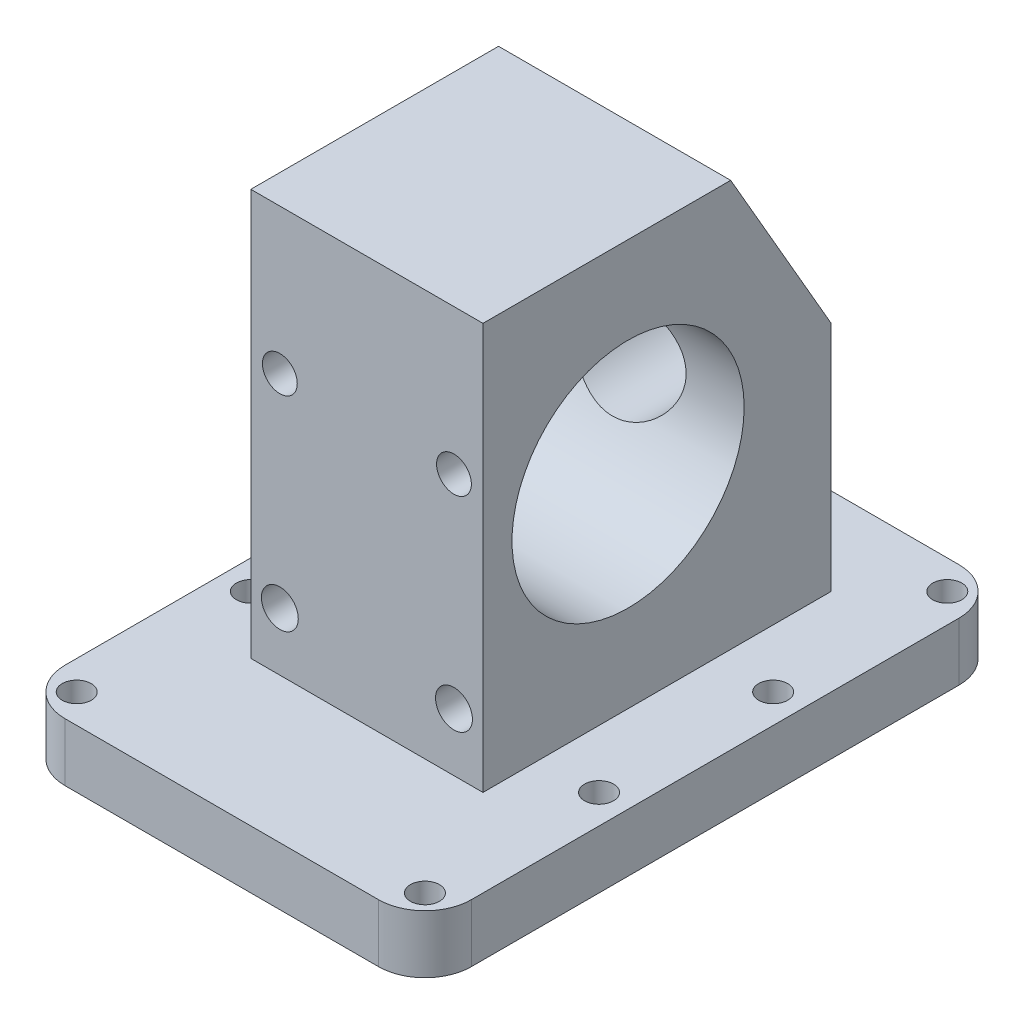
ISO-10303-21;
HEADER;
FILE_DESCRIPTION(('STEP AP214'),'2;1');
FILE_NAME('part.step','',(''),(''),'','','');
FILE_SCHEMA(('AUTOMOTIVE_DESIGN { 1 0 10303 214 1 1 1 1 }'));
ENDSEC;
DATA;
#1=APPLICATION_CONTEXT('core data for automotive mechanical design processes');
#2=APPLICATION_PROTOCOL_DEFINITION('international standard','automotive_design',2000,#1);
#3=PRODUCT_CONTEXT('',#1,'mechanical');
#4=PRODUCT('Part','Part','',(#3));
#5=PRODUCT_RELATED_PRODUCT_CATEGORY('part','',(#4));
#6=PRODUCT_DEFINITION_FORMATION('','',#4);
#7=PRODUCT_DEFINITION_CONTEXT('part definition',#1,'design');
#8=PRODUCT_DEFINITION('design','',#6,#7);
#9=PRODUCT_DEFINITION_SHAPE('','',#8);
#10=(LENGTH_UNIT() NAMED_UNIT(*) SI_UNIT(.MILLI.,.METRE.));
#11=(NAMED_UNIT(*) PLANE_ANGLE_UNIT() SI_UNIT($,.RADIAN.));
#12=(NAMED_UNIT(*) SI_UNIT($,.STERADIAN.) SOLID_ANGLE_UNIT());
#13=UNCERTAINTY_MEASURE_WITH_UNIT(LENGTH_MEASURE(1.E-05),#10,'distance_accuracy_value','');
#14=(GEOMETRIC_REPRESENTATION_CONTEXT(3) GLOBAL_UNCERTAINTY_ASSIGNED_CONTEXT((#13)) GLOBAL_UNIT_ASSIGNED_CONTEXT((#10,
#11,#12)) REPRESENTATION_CONTEXT('',''));
#15=CARTESIAN_POINT('',(0.,0.,0.));
#16=DIRECTION('',(0.,0.,1.));
#17=DIRECTION('',(1.,0.,0.));
#18=AXIS2_PLACEMENT_3D('',#15,#16,#17);
#19=CARTESIAN_POINT('',(20.,35.,25.));
#20=DIRECTION('',(0.,0.,-1.));
#21=DIRECTION('',(0.,1.,0.));
#22=AXIS2_PLACEMENT_3D('',#19,#20,#21);
#23=PLANE('',#22);
#24=CARTESIAN_POINT('',(-15.,-25.,25.));
#25=DIRECTION('',(0.,0.,1.));
#26=DIRECTION('',(1.,0.,0.));
#27=AXIS2_PLACEMENT_3D('',#24,#25,#26);
#28=CIRCLE('',#27,3.17499999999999);
#29=CARTESIAN_POINT('',(-11.825,-25.,25.));
#30=VERTEX_POINT('',#29);
#31=EDGE_CURVE('E362',#30,#30,#28,.T.);
#32=ORIENTED_EDGE('',*,*,#31,.F.);
#33=EDGE_LOOP('',(#32));
#34=FACE_BOUND('',#33,.T.);
#35=CARTESIAN_POINT('',(15.,-25.,25.));
#36=DIRECTION('',(0.,0.,1.));
#37=DIRECTION('',(1.,0.,0.));
#38=AXIS2_PLACEMENT_3D('',#35,#36,#37);
#39=CIRCLE('',#38,3.17499999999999);
#40=CARTESIAN_POINT('',(18.175,-25.,25.));
#41=VERTEX_POINT('',#40);
#42=EDGE_CURVE('E367',#41,#41,#39,.T.);
#43=ORIENTED_EDGE('',*,*,#42,.F.);
#44=EDGE_LOOP('',(#43));
#45=FACE_BOUND('',#44,.T.);
#46=CARTESIAN_POINT('',(15.,9.99999999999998,25.));
#47=DIRECTION('',(0.,0.,1.));
#48=DIRECTION('',(1.,0.,0.));
#49=AXIS2_PLACEMENT_3D('',#46,#47,#48);
#50=CIRCLE('',#49,2.99999999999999);
#51=CARTESIAN_POINT('',(18.,9.99999999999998,25.));
#52=VERTEX_POINT('',#51);
#53=EDGE_CURVE('E385',#52,#52,#50,.T.);
#54=ORIENTED_EDGE('',*,*,#53,.F.);
#55=EDGE_LOOP('',(#54));
#56=FACE_BOUND('',#55,.T.);
#57=DIRECTION('',(0.,-1.,0.));
#58=VECTOR('',#57,1.);
#59=CARTESIAN_POINT('',(-20.,35.,25.));
#60=LINE('',#59,#58);
#61=CARTESIAN_POINT('',(-20.,35.,25.));
#62=VERTEX_POINT('',#61);
#63=CARTESIAN_POINT('',(-20.,-35.,25.));
#64=VERTEX_POINT('',#63);
#65=EDGE_CURVE('E665',#62,#64,#60,.T.);
#66=ORIENTED_EDGE('',*,*,#65,.T.);
#67=DIRECTION('',(-1.,0.,0.));
#68=VECTOR('',#67,1.);
#69=CARTESIAN_POINT('',(20.,-35.,25.));
#70=LINE('',#69,#68);
#71=CARTESIAN_POINT('',(20.,-35.,25.));
#72=VERTEX_POINT('',#71);
#73=EDGE_CURVE('E674',#72,#64,#70,.T.);
#74=ORIENTED_EDGE('',*,*,#73,.F.);
#75=DIRECTION('',(0.,-1.,0.));
#76=VECTOR('',#75,1.);
#77=CARTESIAN_POINT('',(20.,35.,25.));
#78=LINE('',#77,#76);
#79=CARTESIAN_POINT('',(20.,35.,25.));
#80=VERTEX_POINT('',#79);
#81=EDGE_CURVE('E652',#80,#72,#78,.T.);
#82=ORIENTED_EDGE('',*,*,#81,.F.);
#83=DIRECTION('',(-1.,0.,0.));
#84=VECTOR('',#83,1.);
#85=CARTESIAN_POINT('',(20.,35.,25.));
#86=LINE('',#85,#84);
#87=EDGE_CURVE('E678',#80,#62,#86,.T.);
#88=ORIENTED_EDGE('',*,*,#87,.T.);
#89=EDGE_LOOP('',(#66,#74,#82,#88));
#90=FACE_BOUND('',#89,.T.);
#91=CARTESIAN_POINT('',(-15.,9.99999999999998,25.));
#92=DIRECTION('',(0.,0.,1.));
#93=DIRECTION('',(1.,0.,0.));
#94=AXIS2_PLACEMENT_3D('',#91,#92,#93);
#95=CIRCLE('',#94,2.99999999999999);
#96=CARTESIAN_POINT('',(-12.,9.99999999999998,25.));
#97=VERTEX_POINT('',#96);
#98=EDGE_CURVE('E372',#97,#97,#95,.T.);
#99=ORIENTED_EDGE('',*,*,#98,.F.);
#100=EDGE_LOOP('',(#99));
#101=FACE_BOUND('',#100,.T.);
#102=ADVANCED_FACE('F42',(#34,#45,#56,#90,#101),#23,.F.);
#103=CARTESIAN_POINT('',(20.,35.,-35.));
#104=DIRECTION('',(0.,0.,1.));
#105=DIRECTION('',(1.,0.,0.));
#106=AXIS2_PLACEMENT_3D('',#103,#104,#105);
#107=PLANE('',#106);
#108=CARTESIAN_POINT('',(-15.,-25.,-35.));
#109=DIRECTION('',(0.,0.,1.));
#110=DIRECTION('',(1.,0.,0.));
#111=AXIS2_PLACEMENT_3D('',#108,#109,#110);
#112=CIRCLE('',#111,3.17499999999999);
#113=CARTESIAN_POINT('',(-11.825,-25.,-35.));
#114=VERTEX_POINT('',#113);
#115=EDGE_CURVE('E366',#114,#114,#112,.T.);
#116=ORIENTED_EDGE('',*,*,#115,.T.);
#117=EDGE_LOOP('',(#116));
#118=FACE_BOUND('',#117,.T.);
#119=CARTESIAN_POINT('',(15.,-25.,-35.));
#120=DIRECTION('',(0.,0.,1.));
#121=DIRECTION('',(1.,0.,0.));
#122=AXIS2_PLACEMENT_3D('',#119,#120,#121);
#123=CIRCLE('',#122,3.17499999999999);
#124=CARTESIAN_POINT('',(18.175,-25.,-35.));
#125=VERTEX_POINT('',#124);
#126=EDGE_CURVE('E371',#125,#125,#123,.T.);
#127=ORIENTED_EDGE('',*,*,#126,.T.);
#128=EDGE_LOOP('',(#127));
#129=FACE_BOUND('',#128,.T.);
#130=DIRECTION('',(1.,0.,0.));
#131=VECTOR('',#130,1.);
#132=CARTESIAN_POINT('',(-35.,5.,-35.));
#133=LINE('',#132,#131);
#134=CARTESIAN_POINT('',(-20.,5.00000000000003,-35.));
#135=VERTEX_POINT('',#134);
#136=CARTESIAN_POINT('',(-8.66602705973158,5.,-35.));
#137=VERTEX_POINT('',#136);
#138=EDGE_CURVE('E734',#135,#137,#133,.T.);
#139=ORIENTED_EDGE('',*,*,#138,.T.);
#140=CARTESIAN_POINT('',(0.,0.,-35.));
#141=DIRECTION('',(0.,0.,-1.));
#142=DIRECTION('',(-1.,0.,0.));
#143=AXIS2_PLACEMENT_3D('',#140,#141,#142);
#144=CIRCLE('',#143,10.005);
#145=CARTESIAN_POINT('',(8.66602705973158,5.00000000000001,-35.));
#146=VERTEX_POINT('',#145);
#147=EDGE_CURVE('E757',#146,#137,#144,.T.);
#148=ORIENTED_EDGE('',*,*,#147,.F.);
#149=CARTESIAN_POINT('',(20.,5.,-35.));
#150=VERTEX_POINT('',#149);
#151=EDGE_CURVE('E747',#146,#150,#133,.T.);
#152=ORIENTED_EDGE('',*,*,#151,.T.);
#153=DIRECTION('',(0.,1.,0.));
#154=VECTOR('',#153,1.);
#155=CARTESIAN_POINT('',(20.,35.,-35.));
#156=LINE('',#155,#154);
#157=CARTESIAN_POINT('',(20.,-35.,-35.));
#158=VERTEX_POINT('',#157);
#159=EDGE_CURVE('E644',#158,#150,#156,.T.);
#160=ORIENTED_EDGE('',*,*,#159,.F.);
#161=DIRECTION('',(-1.,0.,0.));
#162=VECTOR('',#161,1.);
#163=CARTESIAN_POINT('',(20.,-35.,-35.));
#164=LINE('',#163,#162);
#165=CARTESIAN_POINT('',(-20.,-35.,-35.));
#166=VERTEX_POINT('',#165);
#167=EDGE_CURVE('E658',#158,#166,#164,.T.);
#168=ORIENTED_EDGE('',*,*,#167,.T.);
#169=DIRECTION('',(0.,1.,0.));
#170=VECTOR('',#169,1.);
#171=CARTESIAN_POINT('',(-20.,35.,-35.));
#172=LINE('',#171,#170);
#173=EDGE_CURVE('E639',#166,#135,#172,.T.);
#174=ORIENTED_EDGE('',*,*,#173,.T.);
#175=EDGE_LOOP('',(#139,#148,#152,#160,#168,#174));
#176=FACE_BOUND('',#175,.T.);
#177=ADVANCED_FACE('F539',(#118,#129,#176),#107,.F.);
#178=CARTESIAN_POINT('',(20.,35.,25.));
#179=DIRECTION('',(0.,-1.,0.));
#180=DIRECTION('',(0.,0.,-1.));
#181=AXIS2_PLACEMENT_3D('',#178,#179,#180);
#182=PLANE('',#181);
#183=DIRECTION('',(0.,0.,1.));
#184=VECTOR('',#183,1.);
#185=CARTESIAN_POINT('',(20.,35.,25.));
#186=LINE('',#185,#184);
#187=CARTESIAN_POINT('',(20.,35.,-17.6794919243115));
#188=VERTEX_POINT('',#187);
#189=EDGE_CURVE('E648',#188,#80,#186,.T.);
#190=ORIENTED_EDGE('',*,*,#189,.F.);
#191=DIRECTION('',(1.,0.,0.));
#192=VECTOR('',#191,1.);
#193=CARTESIAN_POINT('',(-35.,35.,-17.6794919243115));
#194=LINE('',#193,#192);
#195=CARTESIAN_POINT('',(-20.,35.,-17.6794919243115));
#196=VERTEX_POINT('',#195);
#197=EDGE_CURVE('E744',#196,#188,#194,.T.);
#198=ORIENTED_EDGE('',*,*,#197,.F.);
#199=DIRECTION('',(0.,0.,1.));
#200=VECTOR('',#199,1.);
#201=CARTESIAN_POINT('',(-20.,35.,25.));
#202=LINE('',#201,#200);
#203=EDGE_CURVE('E662',#196,#62,#202,.T.);
#204=ORIENTED_EDGE('',*,*,#203,.T.);
#205=ORIENTED_EDGE('',*,*,#87,.F.);
#206=EDGE_LOOP('',(#190,#198,#204,#205));
#207=FACE_BOUND('',#206,.T.);
#208=ADVANCED_FACE('F545',(#207),#182,.F.);
#209=CARTESIAN_POINT('',(20.,-35.,-35.));
#210=DIRECTION('',(1.,0.,0.));
#211=DIRECTION('',(0.,0.,-1.));
#212=AXIS2_PLACEMENT_3D('',#209,#210,#211);
#213=PLANE('',#212);
#214=DIRECTION('',(0.,-0.866025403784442,-0.499999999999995));
#215=VECTOR('',#214,1.);
#216=CARTESIAN_POINT('',(20.,35.,-17.6794919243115));
#217=LINE('',#216,#215);
#218=EDGE_CURVE('E748',#188,#150,#217,.T.);
#219=ORIENTED_EDGE('',*,*,#218,.F.);
#220=ORIENTED_EDGE('',*,*,#189,.T.);
#221=ORIENTED_EDGE('',*,*,#81,.T.);
#222=DIRECTION('',(0.,0.,-1.));
#223=VECTOR('',#222,1.);
#224=CARTESIAN_POINT('',(20.,-35.,25.));
#225=LINE('',#224,#223);
#226=EDGE_CURVE('E655',#72,#158,#225,.T.);
#227=ORIENTED_EDGE('',*,*,#226,.T.);
#228=ORIENTED_EDGE('',*,*,#159,.T.);
#229=EDGE_LOOP('',(#219,#220,#221,#227,#228));
#230=FACE_BOUND('',#229,.T.);
#231=CARTESIAN_POINT('',(20.,0.,0.));
#232=DIRECTION('',(1.,0.,0.));
#233=DIRECTION('',(0.,0.,-1.));
#234=AXIS2_PLACEMENT_3D('',#231,#232,#233);
#235=CIRCLE('',#234,20.);
#236=CARTESIAN_POINT('',(20.,0.,-20.));
#237=VERTEX_POINT('',#236);
#238=EDGE_CURVE('E640',#237,#237,#235,.T.);
#239=ORIENTED_EDGE('',*,*,#238,.F.);
#240=EDGE_LOOP('',(#239));
#241=FACE_BOUND('',#240,.T.);
#242=ADVANCED_FACE('F555',(#230,#241),#213,.T.);
#243=CARTESIAN_POINT('',(-20.,-35.,-35.));
#244=DIRECTION('',(1.,0.,0.));
#245=DIRECTION('',(0.,0.,-1.));
#246=AXIS2_PLACEMENT_3D('',#243,#244,#245);
#247=PLANE('',#246);
#248=CARTESIAN_POINT('',(-20.,0.,0.));
#249=DIRECTION('',(1.,0.,0.));
#250=DIRECTION('',(0.,0.,-1.));
#251=AXIS2_PLACEMENT_3D('',#248,#249,#250);
#252=CIRCLE('',#251,20.);
#253=CARTESIAN_POINT('',(-20.,0.,-20.));
#254=VERTEX_POINT('',#253);
#255=EDGE_CURVE('E635',#254,#254,#252,.T.);
#256=ORIENTED_EDGE('',*,*,#255,.T.);
#257=EDGE_LOOP('',(#256));
#258=FACE_BOUND('',#257,.T.);
#259=ORIENTED_EDGE('',*,*,#203,.F.);
#260=DIRECTION('',(0.,-0.866025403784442,-0.499999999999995));
#261=VECTOR('',#260,1.);
#262=CARTESIAN_POINT('',(-20.,-25.0000000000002,-52.3205080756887));
#263=LINE('',#262,#261);
#264=EDGE_CURVE('E682',#196,#135,#263,.T.);
#265=ORIENTED_EDGE('',*,*,#264,.T.);
#266=ORIENTED_EDGE('',*,*,#173,.F.);
#267=DIRECTION('',(0.,0.,-1.));
#268=VECTOR('',#267,1.);
#269=CARTESIAN_POINT('',(-20.,-35.,25.));
#270=LINE('',#269,#268);
#271=EDGE_CURVE('E649',#64,#166,#270,.T.);
#272=ORIENTED_EDGE('',*,*,#271,.F.);
#273=ORIENTED_EDGE('',*,*,#65,.F.);
#274=EDGE_LOOP('',(#259,#265,#266,#272,#273));
#275=FACE_BOUND('',#274,.T.);
#276=ADVANCED_FACE('F552',(#258,#275),#247,.F.);
#277=CARTESIAN_POINT('',(-20.,0.,0.));
#278=DIRECTION('',(1.,0.,0.));
#279=DIRECTION('',(0.,0.,-1.));
#280=AXIS2_PLACEMENT_3D('',#277,#278,#279);
#281=CYLINDRICAL_SURFACE('',#280,20.);
#282=CARTESIAN_POINT('',(-12.,9.99999999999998,17.3205080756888));
#283=CARTESIAN_POINT('',(-12.0000063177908,10.2213727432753,17.192687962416));
#284=CARTESIAN_POINT('',(-12.0245291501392,10.4404561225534,17.0604773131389));
#285=CARTESIAN_POINT('',(-12.1195393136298,10.866474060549,16.7923619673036));
#286=CARTESIAN_POINT('',(-12.1901289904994,11.0733804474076,16.6564496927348));
#287=CARTESIAN_POINT('',(-12.3654380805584,11.44825403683,16.4007213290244));
#288=CARTESIAN_POINT('',(-12.4659496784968,11.618040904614,16.2806755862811));
#289=CARTESIAN_POINT('',(-12.7010972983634,11.9375976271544,16.0478241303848));
#290=CARTESIAN_POINT('',(-12.8356685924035,12.0874046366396,15.9350051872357));
#291=CARTESIAN_POINT('',(-13.0992554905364,12.3259725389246,15.7507787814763));
#292=CARTESIAN_POINT('',(-13.2208132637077,12.4205283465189,15.6761794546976));
#293=CARTESIAN_POINT('',(-13.4816794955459,12.5921003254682,15.5386953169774));
#294=CARTESIAN_POINT('',(-13.6209629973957,12.6691407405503,15.4757943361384));
#295=CARTESIAN_POINT('',(-13.8892366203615,12.7899537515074,15.376024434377));
#296=CARTESIAN_POINT('',(-14.0156695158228,12.8372035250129,15.336516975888));
#297=CARTESIAN_POINT('',(-14.2770388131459,12.9147661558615,15.2712607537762));
#298=CARTESIAN_POINT('',(-14.4119690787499,12.9450910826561,15.2455021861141));
#299=CARTESIAN_POINT('',(-14.6875561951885,12.9869528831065,15.2098601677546));
#300=CARTESIAN_POINT('',(-14.8282389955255,12.9983920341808,15.2000592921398));
#301=CARTESIAN_POINT('',(-15.109960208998,13.001289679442,15.1975812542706));
#302=CARTESIAN_POINT('',(-15.2509985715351,12.992750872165,15.2049017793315));
#303=CARTESIAN_POINT('',(-15.5169958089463,12.9579058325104,15.2346026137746));
#304=CARTESIAN_POINT('',(-15.6423132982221,12.9331444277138,15.2556729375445));
#305=CARTESIAN_POINT('',(-15.8863088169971,12.868865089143,15.3099336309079));
#306=CARTESIAN_POINT('',(-16.0049855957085,12.8293443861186,15.3431262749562));
#307=CARTESIAN_POINT('',(-16.2424979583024,12.7338299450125,15.4225060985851));
#308=CARTESIAN_POINT('',(-16.360644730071,12.6768035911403,15.4694959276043));
#309=CARTESIAN_POINT('',(-16.5855920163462,12.550020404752,15.5725296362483));
#310=CARTESIAN_POINT('',(-16.6923831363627,12.4802531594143,15.6285809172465));
#311=CARTESIAN_POINT('',(-16.9417100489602,12.294357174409,15.7755695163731));
#312=CARTESIAN_POINT('',(-17.0772402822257,12.1719145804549,15.8704619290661));
#313=CARTESIAN_POINT('',(-17.3214858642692,11.9086746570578,16.0689372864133));
#314=CARTESIAN_POINT('',(-17.4301604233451,11.767849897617,16.1725331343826));
#315=CARTESIAN_POINT('',(-17.6211817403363,11.4700422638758,16.3851137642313));
#316=CARTESIAN_POINT('',(-17.7032211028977,11.3128965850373,16.4941457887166));
#317=CARTESIAN_POINT('',(-17.8384175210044,10.9871558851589,16.7128965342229));
#318=CARTESIAN_POINT('',(-17.8915778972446,10.8185621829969,16.822615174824));
#319=CARTESIAN_POINT('',(-17.9722607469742,10.4525954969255,17.0527214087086));
#320=CARTESIAN_POINT('',(-17.9959721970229,10.2541874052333,17.1728219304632));
#321=CARTESIAN_POINT('',(-18.0030802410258,9.85244203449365,17.4064124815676));
#322=CARTESIAN_POINT('',(-17.9864712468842,9.64910407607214,17.5199015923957));
#323=CARTESIAN_POINT('',(-17.9305163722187,9.35056272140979,17.6799080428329));
#324=CARTESIAN_POINT('',(-17.9075421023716,9.25426040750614,17.730489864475));
#325=CARTESIAN_POINT('',(-17.8517047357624,9.0631594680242,17.8289270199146));
#326=CARTESIAN_POINT('',(-17.8188468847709,8.96836007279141,17.8767837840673));
#327=CARTESIAN_POINT('',(-17.7431723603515,8.7813195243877,17.9693997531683));
#328=CARTESIAN_POINT('',(-17.7003606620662,8.68907711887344,18.0141604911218));
#329=CARTESIAN_POINT('',(-17.6048097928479,8.50821589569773,18.1002841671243));
#330=CARTESIAN_POINT('',(-17.5520721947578,8.41959650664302,18.1416476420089));
#331=CARTESIAN_POINT('',(-17.4438616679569,8.25763318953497,18.2158844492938));
#332=CARTESIAN_POINT('',(-17.389496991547,8.18374046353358,18.2491789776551));
#333=CARTESIAN_POINT('',(-17.2735087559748,8.04049770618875,18.3127424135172));
#334=CARTESIAN_POINT('',(-17.2118862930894,7.97114699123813,18.3430117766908));
#335=CARTESIAN_POINT('',(-17.0817657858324,7.83784455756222,18.4003656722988));
#336=CARTESIAN_POINT('',(-17.0132714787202,7.77388993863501,18.4274519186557));
#337=CARTESIAN_POINT('',(-16.869904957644,7.65216857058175,18.478329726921));
#338=CARTESIAN_POINT('',(-16.7950333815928,7.59440120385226,18.5021216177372));
#339=CARTESIAN_POINT('',(-16.5788124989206,7.44348705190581,18.563549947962));
#340=CARTESIAN_POINT('',(-16.4310707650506,7.35779019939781,18.5975525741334));
#341=CARTESIAN_POINT('',(-16.1215085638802,7.21226148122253,18.654475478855));
#342=CARTESIAN_POINT('',(-15.959694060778,7.15241872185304,18.6774004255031));
#343=CARTESIAN_POINT('',(-15.6375888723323,7.06408707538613,18.7109797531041));
#344=CARTESIAN_POINT('',(-15.4778456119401,7.03385891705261,18.7223167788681));
#345=CARTESIAN_POINT('',(-15.1551981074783,6.99962990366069,18.735141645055));
#346=CARTESIAN_POINT('',(-14.9922944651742,6.99562410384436,18.7366313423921));
#347=CARTESIAN_POINT('',(-14.6721413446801,7.01376559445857,18.72984702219));
#348=CARTESIAN_POINT('',(-14.514850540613,7.03528114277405,18.7218088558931));
#349=CARTESIAN_POINT('',(-14.2063494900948,7.10258011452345,18.6963802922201));
#350=CARTESIAN_POINT('',(-14.0551389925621,7.14836253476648,18.6789902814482));
#351=CARTESIAN_POINT('',(-13.7624410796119,7.26262650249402,18.6348596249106));
#352=CARTESIAN_POINT('',(-13.620987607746,7.33118289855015,18.6080881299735));
#353=CARTESIAN_POINT('',(-13.3519765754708,7.4883678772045,18.5453896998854));
#354=CARTESIAN_POINT('',(-13.2244197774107,7.5769975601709,18.5094622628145));
#355=CARTESIAN_POINT('',(-12.9825122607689,7.77406099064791,18.427578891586));
#356=CARTESIAN_POINT('',(-12.8686721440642,7.88300882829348,18.3813545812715));
#357=CARTESIAN_POINT('',(-12.6609991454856,8.11497152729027,18.2801323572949));
#358=CARTESIAN_POINT('',(-12.5671730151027,8.23799111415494,18.2251314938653));
#359=CARTESIAN_POINT('',(-12.3955808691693,8.50221684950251,18.1034455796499));
#360=CARTESIAN_POINT('',(-12.3191982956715,8.64408041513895,18.0362428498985));
#361=CARTESIAN_POINT('',(-12.1910142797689,8.93471450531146,17.8940503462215));
#362=CARTESIAN_POINT('',(-12.1392081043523,9.08348369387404,17.819062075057));
#363=CARTESIAN_POINT('',(-12.065985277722,9.36062615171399,17.6748175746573));
#364=CARTESIAN_POINT('',(-12.0410995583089,9.48858060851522,17.6064785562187));
#365=CARTESIAN_POINT('',(-12.0081020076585,9.74460910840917,17.4660807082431));
#366=CARTESIAN_POINT('',(-11.9999963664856,9.87268317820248,17.3940205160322));
#367=CARTESIAN_POINT('',(-12.,9.99999999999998,17.3205080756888));
#368=B_SPLINE_CURVE_WITH_KNOTS('',3,(#282,#283,#284,#285,#286,#287,#288,#289,#290,#291,#292,
#293,#294,#295,#296,#297,#298,#299,#300,#301,#302,#303,#304,#305,#306,#307,#308,#309,#310,#311,
#312,#313,#314,#315,#316,#317,#318,#319,#320,#321,#322,#323,#324,#325,#326,#327,#328,#329,#330,
#331,#332,#333,#334,#335,#336,#337,#338,#339,#340,#341,#342,#343,#344,#345,#346,#347,#348,#349,
#350,#351,#352,#353,#354,#355,#356,#357,#358,#359,#360,#361,#362,#363,#364,#365,#366,#367),
.UNSPECIFIED.,.T.,.F.,(4,2,2,2,2,2,2,2,2,2,2,2,2,2,2,2,2,2,2,2,2,2,2,2,2,2,2,2,2,2,2,2,2,2,2,2,
2,2,2,2,2,2,4),(0.,0.766208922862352,1.53412593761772,2.22383938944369,2.91225180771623,
3.42377098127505,3.93457777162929,4.35476856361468,4.77465932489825,5.19671603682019,
5.61871574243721,6.00544081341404,6.39223848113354,6.80876412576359,7.2256317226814,
7.83980865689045,8.45491277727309,9.07688236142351,9.69878041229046,10.3948030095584,
11.0909220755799,11.4240618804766,11.7570251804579,12.0898224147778,12.4225669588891,
12.7149390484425,13.007267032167,13.2994368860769,13.5915775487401,14.1110543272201,
14.6303120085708,15.1168238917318,15.6032440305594,16.0778706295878,16.552477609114,
17.0286601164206,17.5048687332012,17.9953548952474,18.4860062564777,19.0075556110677,
19.5290044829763,19.9695073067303,20.4101726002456),.UNSPECIFIED.);
#369=CARTESIAN_POINT('',(-12.,9.99999999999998,17.3205080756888));
#370=VERTEX_POINT('',#369);
#371=EDGE_CURVE('E376',#370,#370,#368,.T.);
#372=ORIENTED_EDGE('',*,*,#371,.T.);
#373=EDGE_LOOP('',(#372));
#374=FACE_BOUND('',#373,.T.);
#375=CARTESIAN_POINT('',(18.,9.99999999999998,17.3205080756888));
#376=CARTESIAN_POINT('',(17.9999936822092,10.2213727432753,17.192687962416));
#377=CARTESIAN_POINT('',(17.9754708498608,10.4404561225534,17.0604773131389));
#378=CARTESIAN_POINT('',(17.8804606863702,10.866474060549,16.7923619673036));
#379=CARTESIAN_POINT('',(17.8098710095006,11.0733804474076,16.6564496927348));
#380=CARTESIAN_POINT('',(17.6345619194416,11.44825403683,16.4007213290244));
#381=CARTESIAN_POINT('',(17.5340503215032,11.618040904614,16.2806755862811));
#382=CARTESIAN_POINT('',(17.2989027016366,11.9375976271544,16.0478241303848));
#383=CARTESIAN_POINT('',(17.1643314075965,12.0874046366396,15.9350051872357));
#384=CARTESIAN_POINT('',(16.9007445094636,12.3259725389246,15.7507787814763));
#385=CARTESIAN_POINT('',(16.7791867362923,12.4205283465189,15.6761794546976));
#386=CARTESIAN_POINT('',(16.5183205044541,12.5921003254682,15.5386953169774));
#387=CARTESIAN_POINT('',(16.3790370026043,12.6691407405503,15.4757943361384));
#388=CARTESIAN_POINT('',(16.1107633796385,12.7899537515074,15.376024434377));
#389=CARTESIAN_POINT('',(15.9843304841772,12.8372035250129,15.336516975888));
#390=CARTESIAN_POINT('',(15.7229611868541,12.9147661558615,15.2712607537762));
#391=CARTESIAN_POINT('',(15.5880309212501,12.9450910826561,15.2455021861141));
#392=CARTESIAN_POINT('',(15.3124438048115,12.9869528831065,15.2098601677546));
#393=CARTESIAN_POINT('',(15.1717610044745,12.9983920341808,15.2000592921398));
#394=CARTESIAN_POINT('',(14.890039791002,13.001289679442,15.1975812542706));
#395=CARTESIAN_POINT('',(14.7490014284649,12.992750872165,15.2049017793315));
#396=CARTESIAN_POINT('',(14.4830041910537,12.9579058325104,15.2346026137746));
#397=CARTESIAN_POINT('',(14.3576867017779,12.9331444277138,15.2556729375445));
#398=CARTESIAN_POINT('',(14.1136911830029,12.868865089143,15.3099336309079));
#399=CARTESIAN_POINT('',(13.9950144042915,12.8293443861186,15.3431262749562));
#400=CARTESIAN_POINT('',(13.7575020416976,12.7338299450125,15.4225060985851));
#401=CARTESIAN_POINT('',(13.639355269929,12.6768035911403,15.4694959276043));
#402=CARTESIAN_POINT('',(13.4144079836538,12.550020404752,15.5725296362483));
#403=CARTESIAN_POINT('',(13.3076168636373,12.4802531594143,15.6285809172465));
#404=CARTESIAN_POINT('',(13.0582899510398,12.294357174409,15.7755695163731));
#405=CARTESIAN_POINT('',(12.9227597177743,12.1719145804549,15.8704619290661));
#406=CARTESIAN_POINT('',(12.6785141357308,11.9086746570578,16.0689372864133));
#407=CARTESIAN_POINT('',(12.5698395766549,11.767849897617,16.1725331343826));
#408=CARTESIAN_POINT('',(12.3788182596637,11.4700422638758,16.3851137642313));
#409=CARTESIAN_POINT('',(12.2967788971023,11.3128965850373,16.4941457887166));
#410=CARTESIAN_POINT('',(12.1615824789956,10.9871558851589,16.7128965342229));
#411=CARTESIAN_POINT('',(12.1084221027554,10.8185621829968,16.822615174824));
#412=CARTESIAN_POINT('',(12.0277392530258,10.4525954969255,17.0527214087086));
#413=CARTESIAN_POINT('',(12.0040278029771,10.2541874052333,17.1728219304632));
#414=CARTESIAN_POINT('',(11.9969197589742,9.85244203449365,17.4064124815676));
#415=CARTESIAN_POINT('',(12.0135287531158,9.64910407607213,17.5199015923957));
#416=CARTESIAN_POINT('',(12.0694836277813,9.35056272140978,17.6799080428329));
#417=CARTESIAN_POINT('',(12.0924578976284,9.25426040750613,17.730489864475));
#418=CARTESIAN_POINT('',(12.1482952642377,9.06315946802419,17.8289270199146));
#419=CARTESIAN_POINT('',(12.1811531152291,8.96836007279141,17.8767837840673));
#420=CARTESIAN_POINT('',(12.2568276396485,8.78131952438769,17.9693997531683));
#421=CARTESIAN_POINT('',(12.2996393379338,8.68907711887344,18.0141604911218));
#422=CARTESIAN_POINT('',(12.3951902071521,8.50821589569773,18.1002841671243));
#423=CARTESIAN_POINT('',(12.4479278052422,8.41959650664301,18.1416476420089));
#424=CARTESIAN_POINT('',(12.5561383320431,8.25763318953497,18.2158844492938));
#425=CARTESIAN_POINT('',(12.610503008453,8.18374046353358,18.2491789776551));
#426=CARTESIAN_POINT('',(12.7264912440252,8.04049770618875,18.3127424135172));
#427=CARTESIAN_POINT('',(12.7881137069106,7.97114699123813,18.3430117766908));
#428=CARTESIAN_POINT('',(12.9182342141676,7.83784455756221,18.4003656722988));
#429=CARTESIAN_POINT('',(12.9867285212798,7.773889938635,18.4274519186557));
#430=CARTESIAN_POINT('',(13.130095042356,7.65216857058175,18.478329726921));
#431=CARTESIAN_POINT('',(13.2049666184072,7.59440120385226,18.5021216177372));
#432=CARTESIAN_POINT('',(13.4211875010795,7.44348705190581,18.563549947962));
#433=CARTESIAN_POINT('',(13.5689292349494,7.35779019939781,18.5975525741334));
#434=CARTESIAN_POINT('',(13.8784914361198,7.21226148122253,18.654475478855));
#435=CARTESIAN_POINT('',(14.040305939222,7.15241872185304,18.6774004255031));
#436=CARTESIAN_POINT('',(14.3624111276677,7.06408707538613,18.710979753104));
#437=CARTESIAN_POINT('',(14.5221543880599,7.03385891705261,18.7223167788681));
#438=CARTESIAN_POINT('',(14.8448018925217,6.99962990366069,18.735141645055));
#439=CARTESIAN_POINT('',(15.0077055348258,6.99562410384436,18.7366313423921));
#440=CARTESIAN_POINT('',(15.3278586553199,7.01376559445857,18.72984702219));
#441=CARTESIAN_POINT('',(15.485149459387,7.03528114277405,18.7218088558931));
#442=CARTESIAN_POINT('',(15.7936505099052,7.10258011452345,18.6963802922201));
#443=CARTESIAN_POINT('',(15.9448610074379,7.14836253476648,18.6789902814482));
#444=CARTESIAN_POINT('',(16.2375589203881,7.26262650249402,18.6348596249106));
#445=CARTESIAN_POINT('',(16.379012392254,7.33118289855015,18.6080881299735));
#446=CARTESIAN_POINT('',(16.6480234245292,7.4883678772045,18.5453896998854));
#447=CARTESIAN_POINT('',(16.7755802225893,7.5769975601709,18.5094622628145));
#448=CARTESIAN_POINT('',(17.0174877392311,7.77406099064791,18.427578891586));
#449=CARTESIAN_POINT('',(17.1313278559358,7.88300882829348,18.3813545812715));
#450=CARTESIAN_POINT('',(17.3390008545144,8.11497152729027,18.2801323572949));
#451=CARTESIAN_POINT('',(17.4328269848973,8.23799111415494,18.2251314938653));
#452=CARTESIAN_POINT('',(17.6044191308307,8.50221684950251,18.1034455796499));
#453=CARTESIAN_POINT('',(17.6808017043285,8.64408041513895,18.0362428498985));
#454=CARTESIAN_POINT('',(17.8089857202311,8.93471450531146,17.8940503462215));
#455=CARTESIAN_POINT('',(17.8607918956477,9.08348369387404,17.819062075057));
#456=CARTESIAN_POINT('',(17.934014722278,9.36062615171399,17.6748175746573));
#457=CARTESIAN_POINT('',(17.9589004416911,9.48858060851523,17.6064785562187));
#458=CARTESIAN_POINT('',(17.9918979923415,9.74460910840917,17.4660807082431));
#459=CARTESIAN_POINT('',(18.0000036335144,9.87268317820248,17.3940205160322));
#460=CARTESIAN_POINT('',(18.,9.99999999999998,17.3205080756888));
#461=B_SPLINE_CURVE_WITH_KNOTS('',3,(#375,#376,#377,#378,#379,#380,#381,#382,#383,#384,#385,
#386,#387,#388,#389,#390,#391,#392,#393,#394,#395,#396,#397,#398,#399,#400,#401,#402,#403,#404,
#405,#406,#407,#408,#409,#410,#411,#412,#413,#414,#415,#416,#417,#418,#419,#420,#421,#422,#423,
#424,#425,#426,#427,#428,#429,#430,#431,#432,#433,#434,#435,#436,#437,#438,#439,#440,#441,#442,
#443,#444,#445,#446,#447,#448,#449,#450,#451,#452,#453,#454,#455,#456,#457,#458,#459,#460),
.UNSPECIFIED.,.T.,.F.,(4,2,2,2,2,2,2,2,2,2,2,2,2,2,2,2,2,2,2,2,2,2,2,2,2,2,2,2,2,2,2,2,2,2,2,2,
2,2,2,2,2,2,4),(0.,0.766208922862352,1.53412593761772,2.22383938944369,2.91225180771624,
3.42377098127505,3.93457777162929,4.35476856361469,4.77465932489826,5.1967160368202,
5.61871574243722,6.00544081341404,6.39223848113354,6.8087641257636,7.2256317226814,
7.83980865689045,8.45491277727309,9.07688236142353,9.69878041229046,10.3948030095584,
11.09092207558,11.4240618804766,11.7570251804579,12.0898224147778,12.4225669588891,
12.7149390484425,13.0072670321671,13.2994368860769,13.5915775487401,14.1110543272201,
14.6303120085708,15.1168238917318,15.6032440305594,16.0778706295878,16.552477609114,
17.0286601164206,17.5048687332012,17.9953548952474,18.4860062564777,19.0075556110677,
19.5290044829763,19.9695073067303,20.4101726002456),.UNSPECIFIED.);
#462=CARTESIAN_POINT('',(18.,9.99999999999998,17.3205080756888));
#463=VERTEX_POINT('',#462);
#464=EDGE_CURVE('E758',#463,#463,#461,.T.);
#465=ORIENTED_EDGE('',*,*,#464,.T.);
#466=EDGE_LOOP('',(#465));
#467=FACE_BOUND('',#466,.T.);
#468=CARTESIAN_POINT('',(-10.005,0.,-20.));
#469=CARTESIAN_POINT('',(-10.0049991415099,-0.263093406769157,-19.9999992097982));
#470=CARTESIAN_POINT('',(-9.99461055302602,-0.52620497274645,-19.9947965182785));
#471=CARTESIAN_POINT('',(-9.9531746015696,-1.05049013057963,-19.9741168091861));
#472=CARTESIAN_POINT('',(-9.92211826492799,-1.31166283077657,-19.958635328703));
#473=CARTESIAN_POINT('',(-9.8396460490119,-1.8304338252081,-19.9177640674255));
#474=CARTESIAN_POINT('',(-9.78819601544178,-2.08802536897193,-19.8923576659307));
#475=CARTESIAN_POINT('',(-9.66553557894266,-2.59731635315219,-19.8322892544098));
#476=CARTESIAN_POINT('',(-9.59432714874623,-2.84901637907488,-19.7976281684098));
#477=CARTESIAN_POINT('',(-9.43322038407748,-3.3439260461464,-19.7200573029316));
#478=CARTESIAN_POINT('',(-9.34339626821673,-3.58716505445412,-19.6771803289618));
#479=CARTESIAN_POINT('',(-9.1457424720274,-4.06475291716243,-19.5841002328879));
#480=CARTESIAN_POINT('',(-9.03791240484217,-4.29910158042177,-19.5338969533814));
#481=CARTESIAN_POINT('',(-8.80519789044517,-4.75758186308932,-19.4273207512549));
#482=CARTESIAN_POINT('',(-8.68031973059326,-4.98171720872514,-19.3709501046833));
#483=CARTESIAN_POINT('',(-8.41434477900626,-5.41888591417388,-19.2532321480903));
#484=CARTESIAN_POINT('',(-8.27324159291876,-5.63191484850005,-19.1918828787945));
#485=CARTESIAN_POINT('',(-7.96676783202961,-6.0583559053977,-19.0617148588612));
#486=CARTESIAN_POINT('',(-7.80044676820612,-6.27101574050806,-18.9926687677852));
#487=CARTESIAN_POINT('',(-7.45163079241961,-6.68175346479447,-18.8520900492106));
#488=CARTESIAN_POINT('',(-7.26913495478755,-6.87983051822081,-18.7805572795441));
#489=CARTESIAN_POINT('',(-6.88882225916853,-7.26062023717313,-18.636653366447));
#490=CARTESIAN_POINT('',(-6.69099590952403,-7.44332323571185,-18.5642817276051));
#491=CARTESIAN_POINT('',(-6.28102524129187,-7.79238374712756,-18.4204885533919));
#492=CARTESIAN_POINT('',(-6.06887824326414,-7.95873818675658,-18.3490671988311));
#493=CARTESIAN_POINT('',(-5.61415382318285,-8.28648581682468,-18.2035370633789));
#494=CARTESIAN_POINT('',(-5.37049347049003,-8.4464806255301,-18.129653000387));
#495=CARTESIAN_POINT('',(-4.86902385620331,-8.74515643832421,-17.9874844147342));
#496=CARTESIAN_POINT('',(-4.61122065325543,-8.88384647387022,-17.9191975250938));
#497=CARTESIAN_POINT('',(-4.08288811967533,-9.1387108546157,-17.7905690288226));
#498=CARTESIAN_POINT('',(-3.81236267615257,-9.25489202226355,-17.7302250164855));
#499=CARTESIAN_POINT('',(-3.26027630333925,-9.46349139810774,-17.6197696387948));
#500=CARTESIAN_POINT('',(-2.97871660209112,-9.55591224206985,-17.5696571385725));
#501=CARTESIAN_POINT('',(-2.4238097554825,-9.71097967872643,-17.4843997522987));
#502=CARTESIAN_POINT('',(-2.15097837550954,-9.77507627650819,-17.4485390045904));
#503=CARTESIAN_POINT('',(-1.59958150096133,-9.88028941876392,-17.3891790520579));
#504=CARTESIAN_POINT('',(-1.32101625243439,-9.92140694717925,-17.3656793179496));
#505=CARTESIAN_POINT('',(-0.760839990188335,-9.97999940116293,-17.3320731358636));
#506=CARTESIAN_POINT('',(-0.479231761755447,-9.99749436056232,-17.3219553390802));
#507=CARTESIAN_POINT('',(0.0846010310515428,-10.0086138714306,-17.3155335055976));
#508=CARTESIAN_POINT('',(0.366825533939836,-10.0022407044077,-17.3192281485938));
#509=CARTESIAN_POINT('',(0.895399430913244,-9.96793768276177,-17.3389886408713));
#510=CARTESIAN_POINT('',(1.14198653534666,-9.94268877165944,-17.3535153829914));
#511=CARTESIAN_POINT('',(1.63190846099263,-9.87411234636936,-17.3926267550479));
#512=CARTESIAN_POINT('',(1.87524217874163,-9.83077885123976,-17.4172147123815));
#513=CARTESIAN_POINT('',(2.35693328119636,-9.72654179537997,-17.4756385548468));
#514=CARTESIAN_POINT('',(2.59529133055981,-9.66564059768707,-17.509473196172));
#515=CARTESIAN_POINT('',(3.06576371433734,-9.52687241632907,-17.5853618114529));
#516=CARTESIAN_POINT('',(3.2978755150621,-9.44899866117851,-17.6274190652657));
#517=CARTESIAN_POINT('',(3.75978619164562,-9.27503782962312,-17.7195816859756));
#518=CARTESIAN_POINT('',(3.98941102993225,-9.1785752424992,-17.7698489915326));
#519=CARTESIAN_POINT('',(4.43977729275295,-8.96939666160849,-17.8763445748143));
#520=CARTESIAN_POINT('',(4.66051573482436,-8.85667526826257,-17.9325748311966));
#521=CARTESIAN_POINT('',(5.09215981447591,-8.61574355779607,-18.0495676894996));
#522=CARTESIAN_POINT('',(5.30306367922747,-8.48753046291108,-18.110331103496));
#523=CARTESIAN_POINT('',(5.71420545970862,-8.21635772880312,-18.2349590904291));
#524=CARTESIAN_POINT('',(5.91444272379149,-8.07339719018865,-18.2988238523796));
#525=CARTESIAN_POINT('',(6.3282755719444,-7.75432924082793,-18.4364930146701));
#526=CARTESIAN_POINT('',(6.54033025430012,-7.57631865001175,-18.5105283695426));
#527=CARTESIAN_POINT('',(6.94887495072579,-7.20344599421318,-18.6587944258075));
#528=CARTESIAN_POINT('',(7.14536884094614,-7.0085881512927,-18.7330250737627));
#529=CARTESIAN_POINT('',(7.52198934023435,-6.60275652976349,-18.8798888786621));
#530=CARTESIAN_POINT('',(7.70210222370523,-6.39176950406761,-18.9525206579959));
#531=CARTESIAN_POINT('',(8.04462464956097,-5.95491801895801,-19.0942835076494));
#532=CARTESIAN_POINT('',(8.2070411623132,-5.72905947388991,-19.1634159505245));
#533=CARTESIAN_POINT('',(8.52030023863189,-5.25257606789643,-19.2996027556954));
#534=CARTESIAN_POINT('',(8.67024295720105,-5.00128649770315,-19.3664076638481));
#535=CARTESIAN_POINT('',(8.94821642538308,-4.48501884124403,-19.4924396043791));
#536=CARTESIAN_POINT('',(9.07624615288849,-4.22004011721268,-19.5516662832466));
#537=CARTESIAN_POINT('',(9.30895156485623,-3.67835243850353,-19.6607730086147));
#538=CARTESIAN_POINT('',(9.41364211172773,-3.40165108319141,-19.7106590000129));
#539=CARTESIAN_POINT('',(9.59848094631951,-2.83848327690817,-19.7996019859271));
#540=CARTESIAN_POINT('',(9.67863206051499,-2.55201795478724,-19.8386602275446));
#541=CARTESIAN_POINT('',(9.80771740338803,-1.99582677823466,-19.901969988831));
#542=CARTESIAN_POINT('',(9.85868850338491,-1.7266816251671,-19.9271804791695));
#543=CARTESIAN_POINT('',(9.9384348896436,-1.18433286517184,-19.966753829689));
#544=CARTESIAN_POINT('',(9.96721138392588,-0.911129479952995,-19.981117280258));
#545=CARTESIAN_POINT('',(10.0021804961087,-0.363032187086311,-19.9985839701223));
#546=CARTESIAN_POINT('',(10.0083821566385,-0.0881390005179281,-20.0016917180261));
#547=CARTESIAN_POINT('',(9.99814154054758,0.461112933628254,-19.9965693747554));
#548=CARTESIAN_POINT('',(9.98170026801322,0.735471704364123,-19.9883397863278));
#549=CARTESIAN_POINT('',(9.92855331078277,1.26011192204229,-19.9618553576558));
#550=CARTESIAN_POINT('',(9.89352203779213,1.51060730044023,-19.9444294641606));
#551=CARTESIAN_POINT('',(9.80478735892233,2.00744712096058,-19.9005613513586));
#552=CARTESIAN_POINT('',(9.75108515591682,2.25379182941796,-19.8741197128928));
#553=CARTESIAN_POINT('',(9.62556528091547,2.74075698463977,-19.812836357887));
#554=CARTESIAN_POINT('',(9.553746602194,2.981377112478,-19.7779941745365));
#555=CARTESIAN_POINT('',(9.39268697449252,3.45545088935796,-19.7006993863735));
#556=CARTESIAN_POINT('',(9.30344529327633,3.68890423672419,-19.6582464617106));
#557=CARTESIAN_POINT('',(9.10554244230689,4.15388351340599,-19.5653525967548));
#558=CARTESIAN_POINT('',(8.99640275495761,4.38516748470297,-19.5147194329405));
#559=CARTESIAN_POINT('',(8.76139185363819,4.83767538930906,-19.4075000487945));
#560=CARTESIAN_POINT('',(8.63551465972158,5.05889568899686,-19.3509117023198));
#561=CARTESIAN_POINT('',(8.23413819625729,5.70581931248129,-19.1740208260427));
#562=CARTESIAN_POINT('',(7.93478788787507,6.11503277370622,-19.0465410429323));
#563=CARTESIAN_POINT('',(7.24721334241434,6.91989751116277,-18.7700189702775));
#564=CARTESIAN_POINT('',(6.85314610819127,7.3102636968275,-18.6200888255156));
#565=CARTESIAN_POINT('',(6.21739499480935,7.84351750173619,-18.3988181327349));
#566=CARTESIAN_POINT('',(5.99786150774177,8.01265608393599,-18.3256137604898));
#567=CARTESIAN_POINT('',(5.54473151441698,8.33263823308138,-18.1823491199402));
#568=CARTESIAN_POINT('',(5.3111329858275,8.48347915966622,-18.1122893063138));
#569=CARTESIAN_POINT('',(4.81930039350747,8.77266776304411,-17.9740717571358));
#570=CARTESIAN_POINT('',(4.56042016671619,8.91004277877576,-17.9061748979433));
#571=CARTESIAN_POINT('',(4.03006275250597,9.16213758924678,-17.7785038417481));
#572=CARTESIAN_POINT('',(3.75859170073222,9.27686827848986,-17.7187257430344));
#573=CARTESIAN_POINT('',(3.20493245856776,9.48238094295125,-17.609599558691));
#574=CARTESIAN_POINT('',(2.92275309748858,9.57318217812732,-17.5602430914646));
#575=CARTESIAN_POINT('',(2.34966767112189,9.72971084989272,-17.4740018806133));
#576=CARTESIAN_POINT('',(2.05876296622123,9.79544217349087,-17.4371152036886));
#577=CARTESIAN_POINT('',(1.49908087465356,9.89574027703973,-17.3803713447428));
#578=CARTESIAN_POINT('',(1.23086104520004,9.93269351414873,-17.3592190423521));
#579=CARTESIAN_POINT('',(0.691620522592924,9.9847401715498,-17.3293357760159));
#580=CARTESIAN_POINT('',(0.420600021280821,9.99983507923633,-17.3206039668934));
#581=CARTESIAN_POINT('',(-0.121778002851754,10.0079335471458,-17.3159258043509));
#582=CARTESIAN_POINT('',(-0.393135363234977,10.0009453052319,-17.3199747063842));
#583=CARTESIAN_POINT('',(-0.93389616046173,9.96500289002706,-17.3406789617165));
#584=CARTESIAN_POINT('',(-1.20329967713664,9.93604961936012,-17.3573337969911));
#585=CARTESIAN_POINT('',(-1.71224149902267,9.86042443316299,-17.4003939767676));
#586=CARTESIAN_POINT('',(-1.95216796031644,9.81571615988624,-17.4257121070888));
#587=CARTESIAN_POINT('',(-2.42713626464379,9.70918574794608,-17.4852919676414));
#588=CARTESIAN_POINT('',(-2.66217646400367,9.64735794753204,-17.5195566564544));
#589=CARTESIAN_POINT('',(-3.12591407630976,9.5072265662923,-17.5959939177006));
#590=CARTESIAN_POINT('',(-3.35461251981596,9.42892568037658,-17.6381651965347));
#591=CARTESIAN_POINT('',(-3.80467420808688,9.25648878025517,-17.7292673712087));
#592=CARTESIAN_POINT('',(-4.02603410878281,9.1623456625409,-17.7782012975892));
#593=CARTESIAN_POINT('',(-4.47489304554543,8.95214011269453,-17.8850215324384));
#594=CARTESIAN_POINT('',(-4.70181213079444,8.83503265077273,-17.9432877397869));
#595=CARTESIAN_POINT('',(-5.1451154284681,8.58444258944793,-18.0645153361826));
#596=CARTESIAN_POINT('',(-5.36149869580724,8.4509585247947,-18.1274771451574));
#597=CARTESIAN_POINT('',(-5.78292584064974,8.16836461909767,-18.2565591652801));
#598=CARTESIAN_POINT('',(-5.98796570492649,8.01924930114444,-18.322680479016));
#599=CARTESIAN_POINT('',(-6.38585000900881,7.70616912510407,-18.4565421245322));
#600=CARTESIAN_POINT('',(-6.57869269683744,7.54220214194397,-18.5242826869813));
#601=CARTESIAN_POINT('',(-6.9741245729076,7.17928534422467,-18.6681669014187));
#602=CARTESIAN_POINT('',(-7.17503452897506,6.97850784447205,-18.7443279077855));
#603=CARTESIAN_POINT('',(-7.55932137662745,6.56028294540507,-18.8947627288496));
#604=CARTESIAN_POINT('',(-7.74270321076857,6.34284027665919,-18.9690370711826));
#605=CARTESIAN_POINT('',(-8.09097345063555,5.89214167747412,-19.1138359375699));
#606=CARTESIAN_POINT('',(-8.25584739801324,5.65887360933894,-19.1843575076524));
#607=CARTESIAN_POINT('',(-8.56568993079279,5.17791474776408,-19.3197204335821));
#608=CARTESIAN_POINT('',(-8.7106596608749,4.93022478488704,-19.3845621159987));
#609=CARTESIAN_POINT('',(-8.98041891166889,4.4199540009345,-19.5072642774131));
#610=CARTESIAN_POINT('',(-9.1050511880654,4.15727656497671,-19.5650695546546));
#611=CARTESIAN_POINT('',(-9.331503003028,3.62048465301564,-19.6714750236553));
#612=CARTESIAN_POINT('',(-9.43332534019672,3.34637158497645,-19.7200763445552));
#613=CARTESIAN_POINT('',(-9.61273415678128,2.78940205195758,-19.8065258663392));
#614=CARTESIAN_POINT('',(-9.69037785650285,2.50656799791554,-19.8443994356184));
#615=CARTESIAN_POINT('',(-9.82067398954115,1.9340351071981,-19.9083494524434));
#616=CARTESIAN_POINT('',(-9.87334167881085,1.64434057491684,-19.9344331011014));
#617=CARTESIAN_POINT('',(-9.94368448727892,1.12879475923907,-19.9693805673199));
#618=CARTESIAN_POINT('',(-9.96665805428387,0.903825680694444,-19.9808427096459));
#619=CARTESIAN_POINT('',(-9.99731639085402,0.452575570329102,-19.9961528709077));
#620=CARTESIAN_POINT('',(-10.005000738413,0.226294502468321,-20.0000006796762));
#621=CARTESIAN_POINT('',(-10.005,0.,-20.));
#622=B_SPLINE_CURVE_WITH_KNOTS('',3,(#468,#469,#470,#471,#472,#473,#474,#475,#476,#477,#478,
#479,#480,#481,#482,#483,#484,#485,#486,#487,#488,#489,#490,#491,#492,#493,#494,#495,#496,#497,
#498,#499,#500,#501,#502,#503,#504,#505,#506,#507,#508,#509,#510,#511,#512,#513,#514,#515,#516,
#517,#518,#519,#520,#521,#522,#523,#524,#525,#526,#527,#528,#529,#530,#531,#532,#533,#534,#535,
#536,#537,#538,#539,#540,#541,#542,#543,#544,#545,#546,#547,#548,#549,#550,#551,#552,#553,#554,
#555,#556,#557,#558,#559,#560,#561,#562,#563,#564,#565,#566,#567,#568,#569,#570,#571,#572,#573,
#574,#575,#576,#577,#578,#579,#580,#581,#582,#583,#584,#585,#586,#587,#588,#589,#590,#591,#592,
#593,#594,#595,#596,#597,#598,#599,#600,#601,#602,#603,#604,#605,#606,#607,#608,#609,#610,#611,
#612,#613,#614,#615,#616,#617,#618,#619,#620,#621),.UNSPECIFIED.,.T.,.F.,(4,2,2,2,2,2,2,2,2,2,2,
2,2,2,2,2,2,2,2,2,2,2,2,2,2,2,2,2,2,2,2,2,2,2,2,2,2,2,2,2,2,2,2,2,2,2,2,2,2,2,2,2,2,2,2,2,2,2,2,
2,2,2,2,2,2,2,2,2,2,2,2,2,2,2,2,2,4),(0.,0.789057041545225,1.57845690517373,2.36918443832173,
3.15983305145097,3.94738807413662,4.7349600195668,5.52224228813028,6.30983589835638,
7.14494633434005,7.98010459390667,8.81578412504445,9.6516204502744,10.5526331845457,
11.4532629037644,12.35361921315,13.2538756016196,14.1002963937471,14.9466809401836,
15.7923472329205,16.637932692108,17.3819611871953,18.1262359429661,18.8704106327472,
19.6148827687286,20.3763658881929,21.1381024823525,21.8999758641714,22.6618957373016,
23.5207373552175,24.3793643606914,25.2387043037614,26.0977045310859,26.9969846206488,
27.8963066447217,28.7950543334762,29.6936984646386,30.5178538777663,31.3419644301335,
32.1657448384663,32.98948871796,33.7492058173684,34.5088739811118,35.2685843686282,
36.0283266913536,36.8095918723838,37.5911369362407,39.1534136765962,40.8692247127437,
41.7283722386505,42.5876435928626,43.4889663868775,44.3898544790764,45.2900152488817,
46.1900363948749,47.0036341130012,47.8171764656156,48.6304168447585,49.4436238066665,
50.1789089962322,50.9144376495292,51.6498460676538,52.3855851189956,53.1705431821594,
53.9555715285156,54.7408758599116,55.5262927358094,56.4074890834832,57.2884362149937,
58.1700668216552,59.0516467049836,59.9397491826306,60.8277426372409,61.7136183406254,
62.5989522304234,63.2776250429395,63.9563165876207),.UNSPECIFIED.);
#623=CARTESIAN_POINT('',(-10.005,0.,-20.));
#624=VERTEX_POINT('',#623);
#625=EDGE_CURVE('E499',#624,#624,#622,.T.);
#626=ORIENTED_EDGE('',*,*,#625,.F.);
#627=EDGE_LOOP('',(#626));
#628=FACE_BOUND('',#627,.T.);
#629=ORIENTED_EDGE('',*,*,#255,.F.);
#630=EDGE_LOOP('',(#629));
#631=FACE_BOUND('',#630,.T.);
#632=ORIENTED_EDGE('',*,*,#238,.T.);
#633=EDGE_LOOP('',(#632));
#634=FACE_BOUND('',#633,.T.);
#635=ADVANCED_FACE('F770',(#374,#467,#628,#631,#634),#281,.F.);
#636=CARTESIAN_POINT('',(-35.,-45.,50.));
#637=DIRECTION('',(1.,0.,0.));
#638=DIRECTION('',(0.,0.,-1.));
#639=AXIS2_PLACEMENT_3D('',#636,#637,#638);
#640=PLANE('',#639);
#641=DIRECTION('',(0.,0.,-1.));
#642=VECTOR('',#641,1.);
#643=CARTESIAN_POINT('',(-35.,-35.,50.));
#644=LINE('',#643,#642);
#645=CARTESIAN_POINT('',(-35.,-35.,42.));
#646=VERTEX_POINT('',#645);
#647=CARTESIAN_POINT('',(-35.,-35.,-42.));
#648=VERTEX_POINT('',#647);
#649=EDGE_CURVE('E720',#646,#648,#644,.T.);
#650=ORIENTED_EDGE('',*,*,#649,.T.);
#651=DIRECTION('',(0.,1.,0.));
#652=VECTOR('',#651,1.);
#653=CARTESIAN_POINT('',(-35.,-45.,-42.));
#654=LINE('',#653,#652);
#655=CARTESIAN_POINT('',(-35.,-45.,-42.));
#656=VERTEX_POINT('',#655);
#657=EDGE_CURVE('E590',#648,#656,#654,.F.);
#658=ORIENTED_EDGE('',*,*,#657,.T.);
#659=DIRECTION('',(0.,0.,-1.));
#660=VECTOR('',#659,1.);
#661=CARTESIAN_POINT('',(-35.,-45.,50.));
#662=LINE('',#661,#660);
#663=CARTESIAN_POINT('',(-35.,-45.,42.));
#664=VERTEX_POINT('',#663);
#665=EDGE_CURVE('E622',#664,#656,#662,.T.);
#666=ORIENTED_EDGE('',*,*,#665,.F.);
#667=DIRECTION('',(0.,1.,0.));
#668=VECTOR('',#667,1.);
#669=CARTESIAN_POINT('',(-35.,-45.,42.));
#670=LINE('',#669,#668);
#671=EDGE_CURVE('E709',#664,#646,#670,.T.);
#672=ORIENTED_EDGE('',*,*,#671,.T.);
#673=EDGE_LOOP('',(#650,#658,#666,#672));
#674=FACE_BOUND('',#673,.T.);
#675=ADVANCED_FACE('F718',(#674),#640,.F.);
#676=CARTESIAN_POINT('',(35.,-45.,-50.));
#677=DIRECTION('',(0.,0.,1.));
#678=DIRECTION('',(1.,0.,0.));
#679=AXIS2_PLACEMENT_3D('',#676,#677,#678);
#680=PLANE('',#679);
#681=DIRECTION('',(1.,0.,0.));
#682=VECTOR('',#681,1.);
#683=CARTESIAN_POINT('',(35.,-45.,-50.));
#684=LINE('',#683,#682);
#685=CARTESIAN_POINT('',(-27.,-45.,-50.));
#686=VERTEX_POINT('',#685);
#687=CARTESIAN_POINT('',(27.,-45.,-50.));
#688=VERTEX_POINT('',#687);
#689=EDGE_CURVE('E629',#686,#688,#684,.T.);
#690=ORIENTED_EDGE('',*,*,#689,.F.);
#691=DIRECTION('',(0.,1.,0.));
#692=VECTOR('',#691,1.);
#693=CARTESIAN_POINT('',(-27.,-45.,-50.));
#694=LINE('',#693,#692);
#695=CARTESIAN_POINT('',(-27.,-35.,-50.));
#696=VERTEX_POINT('',#695);
#697=EDGE_CURVE('E695',#686,#696,#694,.T.);
#698=ORIENTED_EDGE('',*,*,#697,.T.);
#699=DIRECTION('',(1.,0.,0.));
#700=VECTOR('',#699,1.);
#701=CARTESIAN_POINT('',(35.,-35.,-50.));
#702=LINE('',#701,#700);
#703=CARTESIAN_POINT('',(27.,-35.,-50.));
#704=VERTEX_POINT('',#703);
#705=EDGE_CURVE('E631',#696,#704,#702,.T.);
#706=ORIENTED_EDGE('',*,*,#705,.T.);
#707=DIRECTION('',(0.,1.,0.));
#708=VECTOR('',#707,1.);
#709=CARTESIAN_POINT('',(27.,-45.,-50.));
#710=LINE('',#709,#708);
#711=EDGE_CURVE('E686',#704,#688,#710,.F.);
#712=ORIENTED_EDGE('',*,*,#711,.T.);
#713=EDGE_LOOP('',(#690,#698,#706,#712));
#714=FACE_BOUND('',#713,.T.);
#715=ADVANCED_FACE('F729',(#714),#680,.F.);
#716=CARTESIAN_POINT('',(35.,-45.,50.));
#717=DIRECTION('',(-1.,0.,0.));
#718=DIRECTION('',(0.,0.,1.));
#719=AXIS2_PLACEMENT_3D('',#716,#717,#718);
#720=PLANE('',#719);
#721=DIRECTION('',(0.,0.,1.));
#722=VECTOR('',#721,1.);
#723=CARTESIAN_POINT('',(35.,-45.,50.));
#724=LINE('',#723,#722);
#725=CARTESIAN_POINT('',(35.,-45.,-42.));
#726=VERTEX_POINT('',#725);
#727=CARTESIAN_POINT('',(35.,-45.,42.));
#728=VERTEX_POINT('',#727);
#729=EDGE_CURVE('E739',#726,#728,#724,.T.);
#730=ORIENTED_EDGE('',*,*,#729,.F.);
#731=DIRECTION('',(0.,1.,0.));
#732=VECTOR('',#731,1.);
#733=CARTESIAN_POINT('',(35.,-45.,-42.));
#734=LINE('',#733,#732);
#735=CARTESIAN_POINT('',(35.,-35.,-42.));
#736=VERTEX_POINT('',#735);
#737=EDGE_CURVE('E598',#726,#736,#734,.T.);
#738=ORIENTED_EDGE('',*,*,#737,.T.);
#739=DIRECTION('',(0.,0.,1.));
#740=VECTOR('',#739,1.);
#741=CARTESIAN_POINT('',(35.,-35.,50.));
#742=LINE('',#741,#740);
#743=CARTESIAN_POINT('',(35.,-35.,42.));
#744=VERTEX_POINT('',#743);
#745=EDGE_CURVE('E623',#736,#744,#742,.T.);
#746=ORIENTED_EDGE('',*,*,#745,.T.);
#747=DIRECTION('',(0.,1.,0.));
#748=VECTOR('',#747,1.);
#749=CARTESIAN_POINT('',(35.,-45.,42.));
#750=LINE('',#749,#748);
#751=EDGE_CURVE('E575',#744,#728,#750,.F.);
#752=ORIENTED_EDGE('',*,*,#751,.T.);
#753=EDGE_LOOP('',(#730,#738,#746,#752));
#754=FACE_BOUND('',#753,.T.);
#755=ADVANCED_FACE('F791',(#754),#720,.F.);
#756=CARTESIAN_POINT('',(35.,-45.,50.));
#757=DIRECTION('',(0.,0.,-1.));
#758=DIRECTION('',(-1.,0.,0.));
#759=AXIS2_PLACEMENT_3D('',#756,#757,#758);
#760=PLANE('',#759);
#761=DIRECTION('',(-1.,0.,0.));
#762=VECTOR('',#761,1.);
#763=CARTESIAN_POINT('',(35.,-45.,50.));
#764=LINE('',#763,#762);
#765=CARTESIAN_POINT('',(27.,-45.,50.));
#766=VERTEX_POINT('',#765);
#767=CARTESIAN_POINT('',(-27.,-45.,50.));
#768=VERTEX_POINT('',#767);
#769=EDGE_CURVE('E612',#766,#768,#764,.T.);
#770=ORIENTED_EDGE('',*,*,#769,.F.);
#771=DIRECTION('',(0.,1.,0.));
#772=VECTOR('',#771,1.);
#773=CARTESIAN_POINT('',(27.,-45.,50.));
#774=LINE('',#773,#772);
#775=CARTESIAN_POINT('',(27.,-35.,50.));
#776=VERTEX_POINT('',#775);
#777=EDGE_CURVE('E480',#766,#776,#774,.T.);
#778=ORIENTED_EDGE('',*,*,#777,.T.);
#779=DIRECTION('',(-1.,0.,0.));
#780=VECTOR('',#779,1.);
#781=CARTESIAN_POINT('',(35.,-35.,50.));
#782=LINE('',#781,#780);
#783=CARTESIAN_POINT('',(-27.,-35.,50.));
#784=VERTEX_POINT('',#783);
#785=EDGE_CURVE('E611',#776,#784,#782,.T.);
#786=ORIENTED_EDGE('',*,*,#785,.T.);
#787=DIRECTION('',(0.,1.,0.));
#788=VECTOR('',#787,1.);
#789=CARTESIAN_POINT('',(-27.,-45.,50.));
#790=LINE('',#789,#788);
#791=EDGE_CURVE('E601',#784,#768,#790,.F.);
#792=ORIENTED_EDGE('',*,*,#791,.T.);
#793=EDGE_LOOP('',(#770,#778,#786,#792));
#794=FACE_BOUND('',#793,.T.);
#795=ADVANCED_FACE('F610',(#794),#760,.F.);
#796=CARTESIAN_POINT('',(-35.,-45.,-50.));
#797=DIRECTION('',(0.,1.,0.));
#798=DIRECTION('',(0.,0.,1.));
#799=AXIS2_PLACEMENT_3D('',#796,#797,#798);
#800=PLANE('',#799);
#801=CARTESIAN_POINT('',(-30.,-45.,-45.));
#802=DIRECTION('',(0.,1.,0.));
#803=DIRECTION('',(0.,0.,1.));
#804=AXIS2_PLACEMENT_3D('',#801,#802,#803);
#805=CIRCLE('',#804,2.5);
#806=CARTESIAN_POINT('',(-30.,-45.,-42.5));
#807=VERTEX_POINT('',#806);
#808=EDGE_CURVE('E302',#807,#807,#805,.T.);
#809=ORIENTED_EDGE('',*,*,#808,.T.);
#810=EDGE_LOOP('',(#809));
#811=FACE_BOUND('',#810,.T.);
#812=CARTESIAN_POINT('',(30.,-45.,-45.));
#813=DIRECTION('',(0.,1.,0.));
#814=DIRECTION('',(0.,0.,1.));
#815=AXIS2_PLACEMENT_3D('',#812,#813,#814);
#816=CIRCLE('',#815,2.5);
#817=CARTESIAN_POINT('',(30.,-45.,-42.5));
#818=VERTEX_POINT('',#817);
#819=EDGE_CURVE('E310',#818,#818,#816,.T.);
#820=ORIENTED_EDGE('',*,*,#819,.T.);
#821=EDGE_LOOP('',(#820));
#822=FACE_BOUND('',#821,.T.);
#823=CARTESIAN_POINT('',(30.,-45.,-15.));
#824=DIRECTION('',(0.,1.,0.));
#825=DIRECTION('',(0.,0.,1.));
#826=AXIS2_PLACEMENT_3D('',#823,#824,#825);
#827=CIRCLE('',#826,2.5);
#828=CARTESIAN_POINT('',(30.,-45.,-12.5));
#829=VERTEX_POINT('',#828);
#830=EDGE_CURVE('E318',#829,#829,#827,.T.);
#831=ORIENTED_EDGE('',*,*,#830,.T.);
#832=EDGE_LOOP('',(#831));
#833=FACE_BOUND('',#832,.T.);
#834=CARTESIAN_POINT('',(-30.,-45.,-15.));
#835=DIRECTION('',(0.,1.,0.));
#836=DIRECTION('',(0.,0.,1.));
#837=AXIS2_PLACEMENT_3D('',#834,#835,#836);
#838=CIRCLE('',#837,2.5);
#839=CARTESIAN_POINT('',(-30.,-45.,-12.5));
#840=VERTEX_POINT('',#839);
#841=EDGE_CURVE('E326',#840,#840,#838,.T.);
#842=ORIENTED_EDGE('',*,*,#841,.T.);
#843=EDGE_LOOP('',(#842));
#844=FACE_BOUND('',#843,.T.);
#845=CARTESIAN_POINT('',(30.,-45.,15.));
#846=DIRECTION('',(0.,1.,0.));
#847=DIRECTION('',(0.,0.,1.));
#848=AXIS2_PLACEMENT_3D('',#845,#846,#847);
#849=CIRCLE('',#848,2.5);
#850=CARTESIAN_POINT('',(30.,-45.,17.5));
#851=VERTEX_POINT('',#850);
#852=EDGE_CURVE('E334',#851,#851,#849,.T.);
#853=ORIENTED_EDGE('',*,*,#852,.T.);
#854=EDGE_LOOP('',(#853));
#855=FACE_BOUND('',#854,.T.);
#856=CARTESIAN_POINT('',(-30.,-45.,15.));
#857=DIRECTION('',(0.,1.,0.));
#858=DIRECTION('',(0.,0.,1.));
#859=AXIS2_PLACEMENT_3D('',#856,#857,#858);
#860=CIRCLE('',#859,2.5);
#861=CARTESIAN_POINT('',(-30.,-45.,17.5));
#862=VERTEX_POINT('',#861);
#863=EDGE_CURVE('E342',#862,#862,#860,.T.);
#864=ORIENTED_EDGE('',*,*,#863,.T.);
#865=EDGE_LOOP('',(#864));
#866=FACE_BOUND('',#865,.T.);
#867=CARTESIAN_POINT('',(30.,-45.,45.));
#868=DIRECTION('',(0.,1.,0.));
#869=DIRECTION('',(0.,0.,1.));
#870=AXIS2_PLACEMENT_3D('',#867,#868,#869);
#871=CIRCLE('',#870,2.5);
#872=CARTESIAN_POINT('',(30.,-45.,47.5));
#873=VERTEX_POINT('',#872);
#874=EDGE_CURVE('E350',#873,#873,#871,.T.);
#875=ORIENTED_EDGE('',*,*,#874,.T.);
#876=EDGE_LOOP('',(#875));
#877=FACE_BOUND('',#876,.T.);
#878=CARTESIAN_POINT('',(-30.,-45.,45.));
#879=DIRECTION('',(0.,1.,0.));
#880=DIRECTION('',(0.,0.,1.));
#881=AXIS2_PLACEMENT_3D('',#878,#879,#880);
#882=CIRCLE('',#881,2.5);
#883=CARTESIAN_POINT('',(-30.,-45.,47.5));
#884=VERTEX_POINT('',#883);
#885=EDGE_CURVE('E358',#884,#884,#882,.T.);
#886=ORIENTED_EDGE('',*,*,#885,.T.);
#887=EDGE_LOOP('',(#886));
#888=FACE_BOUND('',#887,.T.);
#889=ORIENTED_EDGE('',*,*,#665,.T.);
#890=CARTESIAN_POINT('',(-27.,-45.,-42.));
#891=DIRECTION('',(0.,1.,0.));
#892=DIRECTION('',(0.,0.,1.));
#893=AXIS2_PLACEMENT_3D('',#890,#891,#892);
#894=CIRCLE('',#893,8.);
#895=EDGE_CURVE('E588',#656,#686,#894,.F.);
#896=ORIENTED_EDGE('',*,*,#895,.T.);
#897=ORIENTED_EDGE('',*,*,#689,.T.);
#898=CARTESIAN_POINT('',(27.,-45.,-42.));
#899=DIRECTION('',(0.,1.,0.));
#900=DIRECTION('',(0.,0.,1.));
#901=AXIS2_PLACEMENT_3D('',#898,#899,#900);
#902=CIRCLE('',#901,8.);
#903=EDGE_CURVE('E582',#688,#726,#902,.F.);
#904=ORIENTED_EDGE('',*,*,#903,.T.);
#905=ORIENTED_EDGE('',*,*,#729,.T.);
#906=CARTESIAN_POINT('',(27.,-45.,42.));
#907=DIRECTION('',(0.,1.,0.));
#908=DIRECTION('',(0.,0.,1.));
#909=AXIS2_PLACEMENT_3D('',#906,#907,#908);
#910=CIRCLE('',#909,8.);
#911=EDGE_CURVE('E574',#728,#766,#910,.F.);
#912=ORIENTED_EDGE('',*,*,#911,.T.);
#913=ORIENTED_EDGE('',*,*,#769,.T.);
#914=CARTESIAN_POINT('',(-27.,-45.,42.));
#915=DIRECTION('',(0.,1.,0.));
#916=DIRECTION('',(0.,0.,1.));
#917=AXIS2_PLACEMENT_3D('',#914,#915,#916);
#918=CIRCLE('',#917,8.);
#919=EDGE_CURVE('E583',#768,#664,#918,.F.);
#920=ORIENTED_EDGE('',*,*,#919,.T.);
#921=EDGE_LOOP('',(#889,#896,#897,#904,#905,#912,#913,#920));
#922=FACE_BOUND('',#921,.T.);
#923=ADVANCED_FACE('F722',(#811,#822,#833,#844,#855,#866,#877,#888,#922),#800,.F.);
#924=CARTESIAN_POINT('',(-35.,-35.,-50.));
#925=DIRECTION('',(0.,1.,0.));
#926=DIRECTION('',(0.,0.,1.));
#927=AXIS2_PLACEMENT_3D('',#924,#925,#926);
#928=PLANE('',#927);
#929=CARTESIAN_POINT('',(-30.,-35.,-45.));
#930=DIRECTION('',(0.,1.,0.));
#931=DIRECTION('',(0.,0.,1.));
#932=AXIS2_PLACEMENT_3D('',#929,#930,#931);
#933=CIRCLE('',#932,2.5);
#934=CARTESIAN_POINT('',(-30.,-35.,-42.5));
#935=VERTEX_POINT('',#934);
#936=EDGE_CURVE('E298',#935,#935,#933,.T.);
#937=ORIENTED_EDGE('',*,*,#936,.F.);
#938=EDGE_LOOP('',(#937));
#939=FACE_BOUND('',#938,.T.);
#940=CARTESIAN_POINT('',(30.,-35.,-45.));
#941=DIRECTION('',(0.,1.,0.));
#942=DIRECTION('',(0.,0.,1.));
#943=AXIS2_PLACEMENT_3D('',#940,#941,#942);
#944=CIRCLE('',#943,2.49999999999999);
#945=CARTESIAN_POINT('',(30.,-35.,-42.5));
#946=VERTEX_POINT('',#945);
#947=EDGE_CURVE('E306',#946,#946,#944,.T.);
#948=ORIENTED_EDGE('',*,*,#947,.F.);
#949=EDGE_LOOP('',(#948));
#950=FACE_BOUND('',#949,.T.);
#951=CARTESIAN_POINT('',(30.,-35.,-15.));
#952=DIRECTION('',(0.,1.,0.));
#953=DIRECTION('',(0.,0.,1.));
#954=AXIS2_PLACEMENT_3D('',#951,#952,#953);
#955=CIRCLE('',#954,2.49999999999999);
#956=CARTESIAN_POINT('',(30.,-35.,-12.5));
#957=VERTEX_POINT('',#956);
#958=EDGE_CURVE('E314',#957,#957,#955,.T.);
#959=ORIENTED_EDGE('',*,*,#958,.F.);
#960=EDGE_LOOP('',(#959));
#961=FACE_BOUND('',#960,.T.);
#962=CARTESIAN_POINT('',(-30.,-35.,-15.));
#963=DIRECTION('',(0.,1.,0.));
#964=DIRECTION('',(0.,0.,1.));
#965=AXIS2_PLACEMENT_3D('',#962,#963,#964);
#966=CIRCLE('',#965,2.49999999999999);
#967=CARTESIAN_POINT('',(-30.,-35.,-12.5));
#968=VERTEX_POINT('',#967);
#969=EDGE_CURVE('E322',#968,#968,#966,.T.);
#970=ORIENTED_EDGE('',*,*,#969,.F.);
#971=EDGE_LOOP('',(#970));
#972=FACE_BOUND('',#971,.T.);
#973=CARTESIAN_POINT('',(30.,-35.,15.));
#974=DIRECTION('',(0.,1.,0.));
#975=DIRECTION('',(0.,0.,1.));
#976=AXIS2_PLACEMENT_3D('',#973,#974,#975);
#977=CIRCLE('',#976,2.49999999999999);
#978=CARTESIAN_POINT('',(30.,-35.,17.5));
#979=VERTEX_POINT('',#978);
#980=EDGE_CURVE('E330',#979,#979,#977,.T.);
#981=ORIENTED_EDGE('',*,*,#980,.F.);
#982=EDGE_LOOP('',(#981));
#983=FACE_BOUND('',#982,.T.);
#984=CARTESIAN_POINT('',(-30.,-35.,15.));
#985=DIRECTION('',(0.,1.,0.));
#986=DIRECTION('',(0.,0.,1.));
#987=AXIS2_PLACEMENT_3D('',#984,#985,#986);
#988=CIRCLE('',#987,2.49999999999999);
#989=CARTESIAN_POINT('',(-30.,-35.,17.5));
#990=VERTEX_POINT('',#989);
#991=EDGE_CURVE('E338',#990,#990,#988,.T.);
#992=ORIENTED_EDGE('',*,*,#991,.F.);
#993=EDGE_LOOP('',(#992));
#994=FACE_BOUND('',#993,.T.);
#995=CARTESIAN_POINT('',(30.,-35.,45.));
#996=DIRECTION('',(0.,1.,0.));
#997=DIRECTION('',(0.,0.,1.));
#998=AXIS2_PLACEMENT_3D('',#995,#996,#997);
#999=CIRCLE('',#998,2.49999999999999);
#1000=CARTESIAN_POINT('',(30.,-35.,47.5));
#1001=VERTEX_POINT('',#1000);
#1002=EDGE_CURVE('E346',#1001,#1001,#999,.T.);
#1003=ORIENTED_EDGE('',*,*,#1002,.F.);
#1004=EDGE_LOOP('',(#1003));
#1005=FACE_BOUND('',#1004,.T.);
#1006=CARTESIAN_POINT('',(-30.,-35.,45.));
#1007=DIRECTION('',(0.,1.,0.));
#1008=DIRECTION('',(0.,0.,1.));
#1009=AXIS2_PLACEMENT_3D('',#1006,#1007,#1008);
#1010=CIRCLE('',#1009,2.49999999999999);
#1011=CARTESIAN_POINT('',(-30.,-35.,47.5));
#1012=VERTEX_POINT('',#1011);
#1013=EDGE_CURVE('E354',#1012,#1012,#1010,.T.);
#1014=ORIENTED_EDGE('',*,*,#1013,.F.);
#1015=EDGE_LOOP('',(#1014));
#1016=FACE_BOUND('',#1015,.T.);
#1017=ORIENTED_EDGE('',*,*,#167,.F.);
#1018=ORIENTED_EDGE('',*,*,#226,.F.);
#1019=ORIENTED_EDGE('',*,*,#73,.T.);
#1020=ORIENTED_EDGE('',*,*,#271,.T.);
#1021=EDGE_LOOP('',(#1017,#1018,#1019,#1020));
#1022=FACE_BOUND('',#1021,.T.);
#1023=ORIENTED_EDGE('',*,*,#705,.F.);
#1024=CARTESIAN_POINT('',(-27.,-35.,-42.));
#1025=DIRECTION('',(0.,1.,0.));
#1026=DIRECTION('',(0.,0.,1.));
#1027=AXIS2_PLACEMENT_3D('',#1024,#1025,#1026);
#1028=CIRCLE('',#1027,8.);
#1029=EDGE_CURVE('E706',#696,#648,#1028,.T.);
#1030=ORIENTED_EDGE('',*,*,#1029,.T.);
#1031=ORIENTED_EDGE('',*,*,#649,.F.);
#1032=CARTESIAN_POINT('',(-27.,-35.,42.));
#1033=DIRECTION('',(0.,1.,0.));
#1034=DIRECTION('',(0.,0.,1.));
#1035=AXIS2_PLACEMENT_3D('',#1032,#1033,#1034);
#1036=CIRCLE('',#1035,8.);
#1037=EDGE_CURVE('E620',#646,#784,#1036,.T.);
#1038=ORIENTED_EDGE('',*,*,#1037,.T.);
#1039=ORIENTED_EDGE('',*,*,#785,.F.);
#1040=CARTESIAN_POINT('',(27.,-35.,42.));
#1041=DIRECTION('',(0.,1.,0.));
#1042=DIRECTION('',(0.,0.,1.));
#1043=AXIS2_PLACEMENT_3D('',#1040,#1041,#1042);
#1044=CIRCLE('',#1043,8.);
#1045=EDGE_CURVE('E617',#776,#744,#1044,.T.);
#1046=ORIENTED_EDGE('',*,*,#1045,.T.);
#1047=ORIENTED_EDGE('',*,*,#745,.F.);
#1048=CARTESIAN_POINT('',(27.,-35.,-42.));
#1049=DIRECTION('',(0.,1.,0.));
#1050=DIRECTION('',(0.,0.,1.));
#1051=AXIS2_PLACEMENT_3D('',#1048,#1049,#1050);
#1052=CIRCLE('',#1051,8.);
#1053=EDGE_CURVE('E703',#736,#704,#1052,.T.);
#1054=ORIENTED_EDGE('',*,*,#1053,.T.);
#1055=EDGE_LOOP('',(#1023,#1030,#1031,#1038,#1039,#1046,#1047,#1054));
#1056=FACE_BOUND('',#1055,.T.);
#1057=ADVANCED_FACE('F615',(#939,#950,#961,#972,#983,#994,#1005,#1016,#1022,#1056),#928,.T.);
#1058=CARTESIAN_POINT('',(-35.,35.,-17.6794919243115));
#1059=DIRECTION('',(0.,-0.499999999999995,0.866025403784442));
#1060=DIRECTION('',(0.,-0.866025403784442,-0.499999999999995));
#1061=AXIS2_PLACEMENT_3D('',#1058,#1059,#1060);
#1062=PLANE('',#1061);
#1063=CARTESIAN_POINT('',(-15.,24.0525588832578,-24.0000000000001));
#1064=DIRECTION('',(0.,0.499999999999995,-0.866025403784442));
#1065=DIRECTION('',(0.,0.866025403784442,0.499999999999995));
#1066=AXIS2_PLACEMENT_3D('',#1063,#1064,#1065);
#1067=CIRCLE('',#1066,1.24999999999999);
#1068=CARTESIAN_POINT('',(-15.,25.1350906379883,-23.3750000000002));
#1069=VERTEX_POINT('',#1068);
#1070=EDGE_CURVE('E208',#1069,#1069,#1067,.T.);
#1071=ORIENTED_EDGE('',*,*,#1070,.F.);
#1072=EDGE_LOOP('',(#1071));
#1073=FACE_BOUND('',#1072,.T.);
#1074=CARTESIAN_POINT('',(-15.,18.8564064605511,-27.0000000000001));
#1075=DIRECTION('',(0.,0.499999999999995,-0.866025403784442));
#1076=DIRECTION('',(0.,0.866025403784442,0.499999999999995));
#1077=AXIS2_PLACEMENT_3D('',#1074,#1075,#1076);
#1078=CIRCLE('',#1077,1.24999999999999);
#1079=CARTESIAN_POINT('',(-15.,19.9389382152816,-26.3750000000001));
#1080=VERTEX_POINT('',#1079);
#1081=EDGE_CURVE('E207',#1080,#1080,#1078,.T.);
#1082=ORIENTED_EDGE('',*,*,#1081,.F.);
#1083=EDGE_LOOP('',(#1082));
#1084=FACE_BOUND('',#1083,.T.);
#1085=CARTESIAN_POINT('',(-15.,13.6602540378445,-30.0000000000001));
#1086=DIRECTION('',(0.,0.499999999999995,-0.866025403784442));
#1087=DIRECTION('',(0.,0.866025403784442,0.499999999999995));
#1088=AXIS2_PLACEMENT_3D('',#1085,#1086,#1087);
#1089=CIRCLE('',#1088,1.24999999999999);
#1090=CARTESIAN_POINT('',(-15.,14.742785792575,-29.3750000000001));
#1091=VERTEX_POINT('',#1090);
#1092=EDGE_CURVE('E222',#1091,#1091,#1089,.T.);
#1093=ORIENTED_EDGE('',*,*,#1092,.F.);
#1094=EDGE_LOOP('',(#1093));
#1095=FACE_BOUND('',#1094,.T.);
#1096=CARTESIAN_POINT('',(-5.,24.0525588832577,-24.0000000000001));
#1097=DIRECTION('',(0.,0.499999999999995,-0.866025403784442));
#1098=DIRECTION('',(0.,0.866025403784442,0.499999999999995));
#1099=AXIS2_PLACEMENT_3D('',#1096,#1097,#1098);
#1100=CIRCLE('',#1099,1.24999999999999);
#1101=CARTESIAN_POINT('',(-5.,25.1350906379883,-23.3750000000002));
#1102=VERTEX_POINT('',#1101);
#1103=EDGE_CURVE('E230',#1102,#1102,#1100,.T.);
#1104=ORIENTED_EDGE('',*,*,#1103,.F.);
#1105=EDGE_LOOP('',(#1104));
#1106=FACE_BOUND('',#1105,.T.);
#1107=CARTESIAN_POINT('',(-5.,18.8564064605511,-27.0000000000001));
#1108=DIRECTION('',(0.,0.499999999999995,-0.866025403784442));
#1109=DIRECTION('',(0.,0.866025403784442,0.499999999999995));
#1110=AXIS2_PLACEMENT_3D('',#1107,#1108,#1109);
#1111=CIRCLE('',#1110,1.24999999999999);
#1112=CARTESIAN_POINT('',(-5.,19.9389382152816,-26.3750000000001));
#1113=VERTEX_POINT('',#1112);
#1114=EDGE_CURVE('E238',#1113,#1113,#1111,.T.);
#1115=ORIENTED_EDGE('',*,*,#1114,.F.);
#1116=EDGE_LOOP('',(#1115));
#1117=FACE_BOUND('',#1116,.T.);
#1118=CARTESIAN_POINT('',(-5.,13.6602540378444,-30.0000000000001));
#1119=DIRECTION('',(0.,0.499999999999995,-0.866025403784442));
#1120=DIRECTION('',(0.,0.866025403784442,0.499999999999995));
#1121=AXIS2_PLACEMENT_3D('',#1118,#1119,#1120);
#1122=CIRCLE('',#1121,1.24999999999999);
#1123=CARTESIAN_POINT('',(-5.,14.742785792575,-29.3750000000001));
#1124=VERTEX_POINT('',#1123);
#1125=EDGE_CURVE('E246',#1124,#1124,#1122,.T.);
#1126=ORIENTED_EDGE('',*,*,#1125,.F.);
#1127=EDGE_LOOP('',(#1126));
#1128=FACE_BOUND('',#1127,.T.);
#1129=CARTESIAN_POINT('',(5.,24.0525588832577,-24.0000000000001));
#1130=DIRECTION('',(0.,0.499999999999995,-0.866025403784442));
#1131=DIRECTION('',(0.,0.866025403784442,0.499999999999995));
#1132=AXIS2_PLACEMENT_3D('',#1129,#1130,#1131);
#1133=CIRCLE('',#1132,1.24999999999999);
#1134=CARTESIAN_POINT('',(5.,25.1350906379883,-23.3750000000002));
#1135=VERTEX_POINT('',#1134);
#1136=EDGE_CURVE('E252',#1135,#1135,#1133,.T.);
#1137=ORIENTED_EDGE('',*,*,#1136,.F.);
#1138=EDGE_LOOP('',(#1137));
#1139=FACE_BOUND('',#1138,.T.);
#1140=CARTESIAN_POINT('',(5.,18.8564064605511,-27.0000000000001));
#1141=DIRECTION('',(0.,0.499999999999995,-0.866025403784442));
#1142=DIRECTION('',(0.,0.866025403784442,0.499999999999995));
#1143=AXIS2_PLACEMENT_3D('',#1140,#1141,#1142);
#1144=CIRCLE('',#1143,1.24999999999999);
#1145=CARTESIAN_POINT('',(5.,19.9389382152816,-26.3750000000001));
#1146=VERTEX_POINT('',#1145);
#1147=EDGE_CURVE('E260',#1146,#1146,#1144,.T.);
#1148=ORIENTED_EDGE('',*,*,#1147,.F.);
#1149=EDGE_LOOP('',(#1148));
#1150=FACE_BOUND('',#1149,.T.);
#1151=CARTESIAN_POINT('',(5.,13.6602540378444,-30.0000000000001));
#1152=DIRECTION('',(0.,0.499999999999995,-0.866025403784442));
#1153=DIRECTION('',(0.,0.866025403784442,0.499999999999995));
#1154=AXIS2_PLACEMENT_3D('',#1151,#1152,#1153);
#1155=CIRCLE('',#1154,1.24999999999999);
#1156=CARTESIAN_POINT('',(5.,14.742785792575,-29.3750000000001));
#1157=VERTEX_POINT('',#1156);
#1158=EDGE_CURVE('E268',#1157,#1157,#1155,.T.);
#1159=ORIENTED_EDGE('',*,*,#1158,.F.);
#1160=EDGE_LOOP('',(#1159));
#1161=FACE_BOUND('',#1160,.T.);
#1162=CARTESIAN_POINT('',(15.,24.0525588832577,-24.0000000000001));
#1163=DIRECTION('',(0.,0.499999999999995,-0.866025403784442));
#1164=DIRECTION('',(0.,0.866025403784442,0.499999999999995));
#1165=AXIS2_PLACEMENT_3D('',#1162,#1163,#1164);
#1166=CIRCLE('',#1165,1.24999999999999);
#1167=CARTESIAN_POINT('',(15.,25.1350906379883,-23.3750000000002));
#1168=VERTEX_POINT('',#1167);
#1169=EDGE_CURVE('E274',#1168,#1168,#1166,.T.);
#1170=ORIENTED_EDGE('',*,*,#1169,.F.);
#1171=EDGE_LOOP('',(#1170));
#1172=FACE_BOUND('',#1171,.T.);
#1173=CARTESIAN_POINT('',(15.,18.8564064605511,-27.0000000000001));
#1174=DIRECTION('',(0.,0.499999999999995,-0.866025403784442));
#1175=DIRECTION('',(0.,0.866025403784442,0.499999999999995));
#1176=AXIS2_PLACEMENT_3D('',#1173,#1174,#1175);
#1177=CIRCLE('',#1176,1.24999999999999);
#1178=CARTESIAN_POINT('',(15.,19.9389382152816,-26.3750000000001));
#1179=VERTEX_POINT('',#1178);
#1180=EDGE_CURVE('E282',#1179,#1179,#1177,.T.);
#1181=ORIENTED_EDGE('',*,*,#1180,.F.);
#1182=EDGE_LOOP('',(#1181));
#1183=FACE_BOUND('',#1182,.T.);
#1184=CARTESIAN_POINT('',(15.,13.6602540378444,-30.0000000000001));
#1185=DIRECTION('',(0.,0.499999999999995,-0.866025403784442));
#1186=DIRECTION('',(0.,0.866025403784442,0.499999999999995));
#1187=AXIS2_PLACEMENT_3D('',#1184,#1185,#1186);
#1188=CIRCLE('',#1187,1.24999999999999);
#1189=CARTESIAN_POINT('',(15.,14.742785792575,-29.3750000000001));
#1190=VERTEX_POINT('',#1189);
#1191=EDGE_CURVE('E290',#1190,#1190,#1188,.T.);
#1192=ORIENTED_EDGE('',*,*,#1191,.F.);
#1193=EDGE_LOOP('',(#1192));
#1194=FACE_BOUND('',#1193,.T.);
#1195=ORIENTED_EDGE('',*,*,#151,.F.);
#1196=CARTESIAN_POINT('',(0.,0.,-37.8867513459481));
#1197=DIRECTION('',(0.,-0.499999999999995,0.866025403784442));
#1198=DIRECTION('',(0.,-0.866025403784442,-0.499999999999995));
#1199=AXIS2_PLACEMENT_3D('',#1196,#1197,#1198);
#1200=ELLIPSE('',#1199,11.5527788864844,10.005);
#1201=EDGE_CURVE('E755',#137,#146,#1200,.F.);
#1202=ORIENTED_EDGE('',*,*,#1201,.F.);
#1203=ORIENTED_EDGE('',*,*,#138,.F.);
#1204=ORIENTED_EDGE('',*,*,#264,.F.);
#1205=ORIENTED_EDGE('',*,*,#197,.T.);
#1206=ORIENTED_EDGE('',*,*,#218,.T.);
#1207=EDGE_LOOP('',(#1195,#1202,#1203,#1204,#1205,#1206));
#1208=FACE_BOUND('',#1207,.T.);
#1209=ADVANCED_FACE('F491',(#1073,#1084,#1095,#1106,#1117,#1128,#1139,#1150,#1161,#1172,#1183,
#1194,#1208),#1062,.F.);
#1210=CARTESIAN_POINT('',(0.,0.,50.001));
#1211=DIRECTION('',(0.,0.,-1.));
#1212=DIRECTION('',(-1.,0.,0.));
#1213=AXIS2_PLACEMENT_3D('',#1210,#1211,#1212);
#1214=CYLINDRICAL_SURFACE('',#1213,10.005);
#1215=CARTESIAN_POINT('',(-4.6563043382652,8.8554421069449,-24.1300094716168));
#1216=CARTESIAN_POINT('',(-4.6338086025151,8.86727068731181,-24.1157958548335));
#1217=CARTESIAN_POINT('',(-4.61086637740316,8.87922450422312,-24.102358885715));
#1218=CARTESIAN_POINT('',(-4.56409541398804,8.90335618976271,-24.0772934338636));
#1219=CARTESIAN_POINT('',(-4.54026581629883,8.91553426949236,-24.0656667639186));
#1220=CARTESIAN_POINT('',(-4.49207135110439,8.93991267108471,-24.044637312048));
#1221=CARTESIAN_POINT('',(-4.46771674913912,8.95211085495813,-24.0352088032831));
#1222=CARTESIAN_POINT('',(-4.41832109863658,8.97659326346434,-24.0185729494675));
#1223=CARTESIAN_POINT('',(-4.39328033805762,8.98887745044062,-24.0113646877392));
#1224=CARTESIAN_POINT('',(-4.31065635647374,9.02896973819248,-23.9916449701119));
#1225=CARTESIAN_POINT('',(-4.25188526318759,9.05680483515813,-23.9839209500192));
#1226=CARTESIAN_POINT('',(-4.13326181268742,9.11155802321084,-23.9790348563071));
#1227=CARTESIAN_POINT('',(-4.07340517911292,9.13846991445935,-23.981933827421));
#1228=CARTESIAN_POINT('',(-3.96928230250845,9.18407223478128,-23.9936987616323));
#1229=CARTESIAN_POINT('',(-3.92494121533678,9.20310604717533,-24.0008503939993));
#1230=CARTESIAN_POINT('',(-3.83694112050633,9.24013886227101,-24.0183618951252));
#1231=CARTESIAN_POINT('',(-3.7932795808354,9.25814572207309,-24.0286918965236));
#1232=CARTESIAN_POINT('',(-3.74980000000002,9.27572234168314,-24.0401627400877));
#1233=B_SPLINE_CURVE_WITH_KNOTS('',3,(#1215,#1216,#1217,#1218,#1219,#1220,#1221,#1222,#1223,
#1224,#1225,#1226,#1227,#1228,#1229,#1230,#1231,#1232),.UNSPECIFIED.,.F.,.F.,(4,2,2,2,2,2,2,2,
4),(0.,0.0873723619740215,0.174831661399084,0.261209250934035,0.347551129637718,
0.542855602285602,0.739284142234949,0.885511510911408,1.03040469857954),.UNSPECIFIED.);
#1234=CARTESIAN_POINT('',(-4.6007777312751,8.884417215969,-24.0970766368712));
#1235=VERTEX_POINT('',#1234);
#1236=CARTESIAN_POINT('',(-4.19140454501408,9.08472085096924,-23.9814312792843));
#1237=VERTEX_POINT('',#1236);
#1238=EDGE_CURVE('E57',#1235,#1237,#1233,.T.);
#1239=ORIENTED_EDGE('',*,*,#1238,.T.);
#1240=CARTESIAN_POINT('',(-4.19140454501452,9.08472085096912,-23.9814312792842));
#1241=CARTESIAN_POINT('',(-4.21316334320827,9.07468380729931,-24.0010371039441));
#1242=CARTESIAN_POINT('',(-4.23625571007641,9.06393321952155,-24.0189522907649));
#1243=CARTESIAN_POINT('',(-4.28460990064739,9.0411751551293,-24.0504681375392));
#1244=CARTESIAN_POINT('',(-4.30986994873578,9.02916870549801,-24.0640722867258));
#1245=CARTESIAN_POINT('',(-4.36227544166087,9.00396730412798,-24.0861420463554));
#1246=CARTESIAN_POINT('',(-4.3894324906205,8.9907648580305,-24.094572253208));
#1247=CARTESIAN_POINT('',(-4.44452111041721,8.96365977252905,-24.1057160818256));
#1248=CARTESIAN_POINT('',(-4.472451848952,8.94975787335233,-24.1084356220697));
#1249=CARTESIAN_POINT('',(-4.5172088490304,8.92721743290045,-24.1084413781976));
#1250=CARTESIAN_POINT('',(-4.53409766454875,8.91865106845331,-24.1074390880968));
#1251=CARTESIAN_POINT('',(-4.56764221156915,8.90151815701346,-24.1035940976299));
#1252=CARTESIAN_POINT('',(-4.58429819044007,8.89295162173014,-24.1007535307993));
#1253=CARTESIAN_POINT('',(-4.60077773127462,8.88441721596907,-24.0970766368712));
#1254=B_SPLINE_CURVE_WITH_KNOTS('',3,(#1240,#1241,#1242,#1243,#1244,#1245,#1246,#1247,#1248,
#1249,#1250,#1251,#1252,#1253),.UNSPECIFIED.,.F.,.F.,(4,2,2,2,2,2,4),(0.,0.0929546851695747,
0.185833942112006,0.27934185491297,0.372752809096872,0.429560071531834,0.486301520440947),.UNSPECIFIED.);
#1255=EDGE_CURVE('E11',#1237,#1235,#1254,.T.);
#1256=ORIENTED_EDGE('',*,*,#1255,.T.);
#1257=EDGE_LOOP('',(#1239,#1256));
#1258=FACE_BOUND('',#1257,.T.);
#1259=CARTESIAN_POINT('',(3.74980000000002,9.27572234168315,-24.0401627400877));
#1260=CARTESIAN_POINT('',(3.78867420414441,9.26000502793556,-24.0299058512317));
#1261=CARTESIAN_POINT('',(3.82764992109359,9.24396560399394,-24.020570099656));
#1262=CARTESIAN_POINT('',(3.90599889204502,9.21113602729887,-24.0043628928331));
#1263=CARTESIAN_POINT('',(3.94537314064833,9.19434288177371,-23.9975024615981));
#1264=CARTESIAN_POINT('',(4.06413527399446,9.14276954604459,-23.9816683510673));
#1265=CARTESIAN_POINT('',(4.14390202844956,9.10690041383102,-23.9775197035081));
#1266=CARTESIAN_POINT('',(4.28078758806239,9.04317440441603,-23.9873160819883));
#1267=CARTESIAN_POINT('',(4.33835836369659,9.01568405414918,-23.9968001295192));
#1268=CARTESIAN_POINT('',(4.45017832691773,8.9610153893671,-24.0272993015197));
#1269=CARTESIAN_POINT('',(4.50444262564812,8.93383620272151,-24.0482567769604));
#1270=CARTESIAN_POINT('',(4.57360030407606,8.89845930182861,-24.0823112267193));
#1271=CARTESIAN_POINT('',(4.59044613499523,8.88977968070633,-24.0912264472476));
#1272=CARTESIAN_POINT('',(4.62370055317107,8.87252875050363,-24.1099645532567));
#1273=CARTESIAN_POINT('',(4.64010885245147,8.86395751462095,-24.119788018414));
#1274=CARTESIAN_POINT('',(4.65630433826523,8.85544210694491,-24.1300094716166));
#1275=B_SPLINE_CURVE_WITH_KNOTS('',3,(#1259,#1260,#1261,#1262,#1263,#1264,#1265,#1266,#1267,
#1268,#1269,#1270,#1271,#1272,#1273,#1274),.UNSPECIFIED.,.F.,.F.,(4,2,2,2,2,2,2,4),(0.,
0.129451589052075,0.259472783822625,0.520383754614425,0.712850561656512,0.904359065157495,
0.967174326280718,1.03002995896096),.UNSPECIFIED.);
#1276=CARTESIAN_POINT('',(4.19140454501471,9.08472085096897,-23.9814312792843));
#1277=VERTEX_POINT('',#1276);
#1278=CARTESIAN_POINT('',(4.60077773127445,8.88441721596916,-24.0970766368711));
#1279=VERTEX_POINT('',#1278);
#1280=EDGE_CURVE('E470',#1277,#1279,#1275,.T.);
#1281=ORIENTED_EDGE('',*,*,#1280,.T.);
#1282=CARTESIAN_POINT('',(4.60077773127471,8.88441721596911,-24.0970766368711));
#1283=CARTESIAN_POINT('',(4.57385613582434,8.8983653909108,-24.1031588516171));
#1284=CARTESIAN_POINT('',(4.54637150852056,8.91243639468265,-24.1068942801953));
#1285=CARTESIAN_POINT('',(4.4912079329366,8.94035773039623,-24.1091933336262));
#1286=CARTESIAN_POINT('',(4.46352997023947,8.95420865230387,-24.107774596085));
#1287=CARTESIAN_POINT('',(4.40855540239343,8.98140400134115,-24.0993103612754));
#1288=CARTESIAN_POINT('',(4.38126198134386,8.99474498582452,-24.0922319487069));
#1289=CARTESIAN_POINT('',(4.32817521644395,9.02040984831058,-24.0726881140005));
#1290=CARTESIAN_POINT('',(4.30238208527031,9.03273358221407,-24.0602219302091));
#1291=CARTESIAN_POINT('',(4.26241911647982,9.05163498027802,-24.0363766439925));
#1292=CARTESIAN_POINT('',(4.24757184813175,9.05860984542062,-24.026400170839));
#1293=CARTESIAN_POINT('',(4.21879798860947,9.07204601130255,-24.0049686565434));
#1294=CARTESIAN_POINT('',(4.20486922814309,9.07850852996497,-23.9935173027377));
#1295=CARTESIAN_POINT('',(4.1914045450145,9.08472085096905,-23.9814312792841));
#1296=B_SPLINE_CURVE_WITH_KNOTS('',3,(#1282,#1283,#1284,#1285,#1286,#1287,#1288,#1289,#1290,
#1291,#1292,#1293,#1294,#1295),.UNSPECIFIED.,.F.,.F.,(4,2,2,2,2,2,4),(0.,0.0928138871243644,
0.185310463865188,0.278348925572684,0.371400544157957,0.428919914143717,0.486298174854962),.UNSPECIFIED.);
#1297=EDGE_CURVE('E479',#1279,#1277,#1296,.T.);
#1298=ORIENTED_EDGE('',*,*,#1297,.T.);
#1299=EDGE_LOOP('',(#1281,#1298));
#1300=FACE_BOUND('',#1299,.T.);
#1301=ORIENTED_EDGE('',*,*,#1201,.T.);
#1302=ORIENTED_EDGE('',*,*,#147,.T.);
#1303=EDGE_LOOP('',(#1301,#1302));
#1304=FACE_BOUND('',#1303,.T.);
#1305=ORIENTED_EDGE('',*,*,#625,.T.);
#1306=EDGE_LOOP('',(#1305));
#1307=FACE_BOUND('',#1306,.T.);
#1308=ADVANCED_FACE('F486',(#1258,#1300,#1304,#1307),#1214,.F.);
#1309=CARTESIAN_POINT('',(15.,9.99999999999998,25.));
#1310=DIRECTION('',(0.,0.,1.));
#1311=DIRECTION('',(1.,0.,0.));
#1312=AXIS2_PLACEMENT_3D('',#1309,#1310,#1311);
#1313=CYLINDRICAL_SURFACE('',#1312,2.99999999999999);
#1314=ORIENTED_EDGE('',*,*,#464,.F.);
#1315=EDGE_LOOP('',(#1314));
#1316=FACE_BOUND('',#1315,.T.);
#1317=ORIENTED_EDGE('',*,*,#53,.T.);
#1318=EDGE_LOOP('',(#1317));
#1319=FACE_BOUND('',#1318,.T.);
#1320=ADVANCED_FACE('F394',(#1316,#1319),#1313,.F.);
#1321=CARTESIAN_POINT('',(-15.,9.99999999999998,25.));
#1322=DIRECTION('',(0.,0.,1.));
#1323=DIRECTION('',(1.,0.,0.));
#1324=AXIS2_PLACEMENT_3D('',#1321,#1322,#1323);
#1325=CYLINDRICAL_SURFACE('',#1324,2.99999999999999);
#1326=ORIENTED_EDGE('',*,*,#371,.F.);
#1327=EDGE_LOOP('',(#1326));
#1328=FACE_BOUND('',#1327,.T.);
#1329=ORIENTED_EDGE('',*,*,#98,.T.);
#1330=EDGE_LOOP('',(#1329));
#1331=FACE_BOUND('',#1330,.T.);
#1332=ADVANCED_FACE('F389',(#1328,#1331),#1325,.F.);
#1333=CARTESIAN_POINT('',(15.,-25.,25.));
#1334=DIRECTION('',(0.,0.,1.));
#1335=DIRECTION('',(1.,0.,0.));
#1336=AXIS2_PLACEMENT_3D('',#1333,#1334,#1335);
#1337=CYLINDRICAL_SURFACE('',#1336,3.17499999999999);
#1338=ORIENTED_EDGE('',*,*,#42,.T.);
#1339=EDGE_LOOP('',(#1338));
#1340=FACE_BOUND('',#1339,.T.);
#1341=ORIENTED_EDGE('',*,*,#126,.F.);
#1342=EDGE_LOOP('',(#1341));
#1343=FACE_BOUND('',#1342,.T.);
#1344=ADVANCED_FACE('F393',(#1340,#1343),#1337,.F.);
#1345=CARTESIAN_POINT('',(-15.,-25.,25.));
#1346=DIRECTION('',(0.,0.,1.));
#1347=DIRECTION('',(1.,0.,0.));
#1348=AXIS2_PLACEMENT_3D('',#1345,#1346,#1347);
#1349=CYLINDRICAL_SURFACE('',#1348,3.17499999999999);
#1350=ORIENTED_EDGE('',*,*,#31,.T.);
#1351=EDGE_LOOP('',(#1350));
#1352=FACE_BOUND('',#1351,.T.);
#1353=ORIENTED_EDGE('',*,*,#115,.F.);
#1354=EDGE_LOOP('',(#1353));
#1355=FACE_BOUND('',#1354,.T.);
#1356=ADVANCED_FACE('F398',(#1352,#1355),#1349,.F.);
#1357=CARTESIAN_POINT('',(-30.,-35.,45.));
#1358=DIRECTION('',(0.,1.,0.));
#1359=DIRECTION('',(0.,0.,1.));
#1360=AXIS2_PLACEMENT_3D('',#1357,#1358,#1359);
#1361=CYLINDRICAL_SURFACE('',#1360,2.49999999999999);
#1362=ORIENTED_EDGE('',*,*,#885,.F.);
#1363=EDGE_LOOP('',(#1362));
#1364=FACE_BOUND('',#1363,.T.);
#1365=ORIENTED_EDGE('',*,*,#1013,.T.);
#1366=EDGE_LOOP('',(#1365));
#1367=FACE_BOUND('',#1366,.T.);
#1368=ADVANCED_FACE('F402',(#1364,#1367),#1361,.F.);
#1369=CARTESIAN_POINT('',(30.,-35.,45.));
#1370=DIRECTION('',(0.,1.,0.));
#1371=DIRECTION('',(0.,0.,1.));
#1372=AXIS2_PLACEMENT_3D('',#1369,#1370,#1371);
#1373=CYLINDRICAL_SURFACE('',#1372,2.49999999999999);
#1374=ORIENTED_EDGE('',*,*,#874,.F.);
#1375=EDGE_LOOP('',(#1374));
#1376=FACE_BOUND('',#1375,.T.);
#1377=ORIENTED_EDGE('',*,*,#1002,.T.);
#1378=EDGE_LOOP('',(#1377));
#1379=FACE_BOUND('',#1378,.T.);
#1380=ADVANCED_FACE('F406',(#1376,#1379),#1373,.F.);
#1381=CARTESIAN_POINT('',(-30.,-35.,15.));
#1382=DIRECTION('',(0.,1.,0.));
#1383=DIRECTION('',(0.,0.,1.));
#1384=AXIS2_PLACEMENT_3D('',#1381,#1382,#1383);
#1385=CYLINDRICAL_SURFACE('',#1384,2.49999999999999);
#1386=ORIENTED_EDGE('',*,*,#863,.F.);
#1387=EDGE_LOOP('',(#1386));
#1388=FACE_BOUND('',#1387,.T.);
#1389=ORIENTED_EDGE('',*,*,#991,.T.);
#1390=EDGE_LOOP('',(#1389));
#1391=FACE_BOUND('',#1390,.T.);
#1392=ADVANCED_FACE('F410',(#1388,#1391),#1385,.F.);
#1393=CARTESIAN_POINT('',(30.,-35.,15.));
#1394=DIRECTION('',(0.,1.,0.));
#1395=DIRECTION('',(0.,0.,1.));
#1396=AXIS2_PLACEMENT_3D('',#1393,#1394,#1395);
#1397=CYLINDRICAL_SURFACE('',#1396,2.5);
#1398=ORIENTED_EDGE('',*,*,#852,.F.);
#1399=EDGE_LOOP('',(#1398));
#1400=FACE_BOUND('',#1399,.T.);
#1401=ORIENTED_EDGE('',*,*,#980,.T.);
#1402=EDGE_LOOP('',(#1401));
#1403=FACE_BOUND('',#1402,.T.);
#1404=ADVANCED_FACE('F414',(#1400,#1403),#1397,.F.);
#1405=CARTESIAN_POINT('',(-30.,-35.,-15.));
#1406=DIRECTION('',(0.,1.,0.));
#1407=DIRECTION('',(0.,0.,1.));
#1408=AXIS2_PLACEMENT_3D('',#1405,#1406,#1407);
#1409=CYLINDRICAL_SURFACE('',#1408,2.49999999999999);
#1410=ORIENTED_EDGE('',*,*,#841,.F.);
#1411=EDGE_LOOP('',(#1410));
#1412=FACE_BOUND('',#1411,.T.);
#1413=ORIENTED_EDGE('',*,*,#969,.T.);
#1414=EDGE_LOOP('',(#1413));
#1415=FACE_BOUND('',#1414,.T.);
#1416=ADVANCED_FACE('F418',(#1412,#1415),#1409,.F.);
#1417=CARTESIAN_POINT('',(30.,-35.,-15.));
#1418=DIRECTION('',(0.,1.,0.));
#1419=DIRECTION('',(0.,0.,1.));
#1420=AXIS2_PLACEMENT_3D('',#1417,#1418,#1419);
#1421=CYLINDRICAL_SURFACE('',#1420,2.5);
#1422=ORIENTED_EDGE('',*,*,#830,.F.);
#1423=EDGE_LOOP('',(#1422));
#1424=FACE_BOUND('',#1423,.T.);
#1425=ORIENTED_EDGE('',*,*,#958,.T.);
#1426=EDGE_LOOP('',(#1425));
#1427=FACE_BOUND('',#1426,.T.);
#1428=ADVANCED_FACE('F422',(#1424,#1427),#1421,.F.);
#1429=CARTESIAN_POINT('',(30.,-35.,-45.));
#1430=DIRECTION('',(0.,1.,0.));
#1431=DIRECTION('',(0.,0.,1.));
#1432=AXIS2_PLACEMENT_3D('',#1429,#1430,#1431);
#1433=CYLINDRICAL_SURFACE('',#1432,2.5);
#1434=ORIENTED_EDGE('',*,*,#819,.F.);
#1435=EDGE_LOOP('',(#1434));
#1436=FACE_BOUND('',#1435,.T.);
#1437=ORIENTED_EDGE('',*,*,#947,.T.);
#1438=EDGE_LOOP('',(#1437));
#1439=FACE_BOUND('',#1438,.T.);
#1440=ADVANCED_FACE('F426',(#1436,#1439),#1433,.F.);
#1441=CARTESIAN_POINT('',(-30.,-35.,-45.));
#1442=DIRECTION('',(0.,1.,0.));
#1443=DIRECTION('',(0.,0.,1.));
#1444=AXIS2_PLACEMENT_3D('',#1441,#1442,#1443);
#1445=CYLINDRICAL_SURFACE('',#1444,2.5);
#1446=ORIENTED_EDGE('',*,*,#808,.F.);
#1447=EDGE_LOOP('',(#1446));
#1448=FACE_BOUND('',#1447,.T.);
#1449=ORIENTED_EDGE('',*,*,#936,.T.);
#1450=EDGE_LOOP('',(#1449));
#1451=FACE_BOUND('',#1450,.T.);
#1452=ADVANCED_FACE('F430',(#1448,#1451),#1445,.F.);
#1453=CARTESIAN_POINT('',(-27.,-45.,-42.));
#1454=DIRECTION('',(0.,1.,0.));
#1455=DIRECTION('',(0.,0.,1.));
#1456=AXIS2_PLACEMENT_3D('',#1453,#1454,#1455);
#1457=CYLINDRICAL_SURFACE('',#1456,8.);
#1458=ORIENTED_EDGE('',*,*,#895,.F.);
#1459=ORIENTED_EDGE('',*,*,#657,.F.);
#1460=ORIENTED_EDGE('',*,*,#1029,.F.);
#1461=ORIENTED_EDGE('',*,*,#697,.F.);
#1462=EDGE_LOOP('',(#1458,#1459,#1460,#1461));
#1463=FACE_BOUND('',#1462,.T.);
#1464=ADVANCED_FACE('F434',(#1463),#1457,.T.);
#1465=CARTESIAN_POINT('',(27.,-45.,-42.));
#1466=DIRECTION('',(0.,1.,0.));
#1467=DIRECTION('',(0.,0.,1.));
#1468=AXIS2_PLACEMENT_3D('',#1465,#1466,#1467);
#1469=CYLINDRICAL_SURFACE('',#1468,8.);
#1470=ORIENTED_EDGE('',*,*,#903,.F.);
#1471=ORIENTED_EDGE('',*,*,#711,.F.);
#1472=ORIENTED_EDGE('',*,*,#1053,.F.);
#1473=ORIENTED_EDGE('',*,*,#737,.F.);
#1474=EDGE_LOOP('',(#1470,#1471,#1472,#1473));
#1475=FACE_BOUND('',#1474,.T.);
#1476=ADVANCED_FACE('F560',(#1475),#1469,.T.);
#1477=CARTESIAN_POINT('',(27.,-45.,42.));
#1478=DIRECTION('',(0.,1.,0.));
#1479=DIRECTION('',(0.,0.,1.));
#1480=AXIS2_PLACEMENT_3D('',#1477,#1478,#1479);
#1481=CYLINDRICAL_SURFACE('',#1480,8.);
#1482=ORIENTED_EDGE('',*,*,#911,.F.);
#1483=ORIENTED_EDGE('',*,*,#751,.F.);
#1484=ORIENTED_EDGE('',*,*,#1045,.F.);
#1485=ORIENTED_EDGE('',*,*,#777,.F.);
#1486=EDGE_LOOP('',(#1482,#1483,#1484,#1485));
#1487=FACE_BOUND('',#1486,.T.);
#1488=ADVANCED_FACE('F563',(#1487),#1481,.T.);
#1489=CARTESIAN_POINT('',(-27.,-45.,42.));
#1490=DIRECTION('',(0.,1.,0.));
#1491=DIRECTION('',(0.,0.,1.));
#1492=AXIS2_PLACEMENT_3D('',#1489,#1490,#1491);
#1493=CYLINDRICAL_SURFACE('',#1492,8.);
#1494=ORIENTED_EDGE('',*,*,#919,.F.);
#1495=ORIENTED_EDGE('',*,*,#791,.F.);
#1496=ORIENTED_EDGE('',*,*,#1037,.F.);
#1497=ORIENTED_EDGE('',*,*,#671,.F.);
#1498=EDGE_LOOP('',(#1494,#1495,#1496,#1497));
#1499=FACE_BOUND('',#1498,.T.);
#1500=ADVANCED_FACE('F44',(#1499),#1493,.T.);
#1501=CARTESIAN_POINT('',(15.,9.91025403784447,-23.5048094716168));
#1502=DIRECTION('',(0.,0.499999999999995,-0.866025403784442));
#1503=DIRECTION('',(0.,0.866025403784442,0.499999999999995));
#1504=AXIS2_PLACEMENT_3D('',#1501,#1502,#1503);
#1505=CONICAL_SURFACE('',#1504,1.24999999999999,1.02974425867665);
#1506=CARTESIAN_POINT('',(15.,9.53471615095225,-22.8543587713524));
#1507=VERTEX_POINT('',#1506);
#1508=VERTEX_LOOP('',#1507);
#1509=FACE_BOUND('',#1508,.T.);
#1510=CARTESIAN_POINT('',(15.,9.91025403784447,-23.5048094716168));
#1511=DIRECTION('',(0.,0.499999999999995,-0.866025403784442));
#1512=DIRECTION('',(0.,0.866025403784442,0.499999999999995));
#1513=AXIS2_PLACEMENT_3D('',#1510,#1511,#1512);
#1514=CIRCLE('',#1513,1.24999999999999);
#1515=CARTESIAN_POINT('',(15.,10.992785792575,-22.8798094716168));
#1516=VERTEX_POINT('',#1515);
#1517=EDGE_CURVE('E294',#1516,#1516,#1514,.T.);
#1518=ORIENTED_EDGE('',*,*,#1517,.T.);
#1519=EDGE_LOOP('',(#1518));
#1520=FACE_BOUND('',#1519,.T.);
#1521=ADVANCED_FACE('F436',(#1509,#1520),#1505,.F.);
#1522=CARTESIAN_POINT('',(15.,13.6602540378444,-30.0000000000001));
#1523=DIRECTION('',(0.,0.499999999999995,-0.866025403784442));
#1524=DIRECTION('',(0.,0.866025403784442,0.499999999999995));
#1525=AXIS2_PLACEMENT_3D('',#1522,#1523,#1524);
#1526=CYLINDRICAL_SURFACE('',#1525,1.24999999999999);
#1527=ORIENTED_EDGE('',*,*,#1517,.F.);
#1528=EDGE_LOOP('',(#1527));
#1529=FACE_BOUND('',#1528,.T.);
#1530=ORIENTED_EDGE('',*,*,#1191,.T.);
#1531=EDGE_LOOP('',(#1530));
#1532=FACE_BOUND('',#1531,.T.);
#1533=ADVANCED_FACE('F439',(#1529,#1532),#1526,.F.);
#1534=CARTESIAN_POINT('',(15.,15.1064064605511,-20.5048094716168));
#1535=DIRECTION('',(0.,0.499999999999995,-0.866025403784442));
#1536=DIRECTION('',(0.,0.866025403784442,0.499999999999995));
#1537=AXIS2_PLACEMENT_3D('',#1534,#1535,#1536);
#1538=CONICAL_SURFACE('',#1537,1.24999999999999,1.02974425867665);
#1539=CARTESIAN_POINT('',(15.,14.7308685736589,-19.8543587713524));
#1540=VERTEX_POINT('',#1539);
#1541=VERTEX_LOOP('',#1540);
#1542=FACE_BOUND('',#1541,.T.);
#1543=CARTESIAN_POINT('',(15.,15.1064064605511,-20.5048094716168));
#1544=DIRECTION('',(0.,0.499999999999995,-0.866025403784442));
#1545=DIRECTION('',(0.,0.866025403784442,0.499999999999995));
#1546=AXIS2_PLACEMENT_3D('',#1543,#1544,#1545);
#1547=CIRCLE('',#1546,1.24999999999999);
#1548=CARTESIAN_POINT('',(15.,16.1889382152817,-19.8798094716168));
#1549=VERTEX_POINT('',#1548);
#1550=EDGE_CURVE('E286',#1549,#1549,#1547,.T.);
#1551=ORIENTED_EDGE('',*,*,#1550,.T.);
#1552=EDGE_LOOP('',(#1551));
#1553=FACE_BOUND('',#1552,.T.);
#1554=ADVANCED_FACE('F443',(#1542,#1553),#1538,.F.);
#1555=CARTESIAN_POINT('',(15.,18.8564064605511,-27.0000000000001));
#1556=DIRECTION('',(0.,0.499999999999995,-0.866025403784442));
#1557=DIRECTION('',(0.,0.866025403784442,0.499999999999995));
#1558=AXIS2_PLACEMENT_3D('',#1555,#1556,#1557);
#1559=CYLINDRICAL_SURFACE('',#1558,1.24999999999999);
#1560=ORIENTED_EDGE('',*,*,#1550,.F.);
#1561=EDGE_LOOP('',(#1560));
#1562=FACE_BOUND('',#1561,.T.);
#1563=ORIENTED_EDGE('',*,*,#1180,.T.);
#1564=EDGE_LOOP('',(#1563));
#1565=FACE_BOUND('',#1564,.T.);
#1566=ADVANCED_FACE('F447',(#1562,#1565),#1559,.F.);
#1567=CARTESIAN_POINT('',(15.,20.3025588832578,-17.5048094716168));
#1568=DIRECTION('',(0.,0.499999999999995,-0.866025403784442));
#1569=DIRECTION('',(0.,0.866025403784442,0.499999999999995));
#1570=AXIS2_PLACEMENT_3D('',#1567,#1568,#1569);
#1571=CONICAL_SURFACE('',#1570,1.24999999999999,1.02974425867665);
#1572=CARTESIAN_POINT('',(15.,19.9270209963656,-16.8543587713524));
#1573=VERTEX_POINT('',#1572);
#1574=VERTEX_LOOP('',#1573);
#1575=FACE_BOUND('',#1574,.T.);
#1576=CARTESIAN_POINT('',(15.,20.3025588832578,-17.5048094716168));
#1577=DIRECTION('',(0.,0.499999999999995,-0.866025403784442));
#1578=DIRECTION('',(0.,0.866025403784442,0.499999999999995));
#1579=AXIS2_PLACEMENT_3D('',#1576,#1577,#1578);
#1580=CIRCLE('',#1579,1.24999999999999);
#1581=CARTESIAN_POINT('',(15.,21.3850906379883,-16.8798094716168));
#1582=VERTEX_POINT('',#1581);
#1583=EDGE_CURVE('E278',#1582,#1582,#1580,.T.);
#1584=ORIENTED_EDGE('',*,*,#1583,.T.);
#1585=EDGE_LOOP('',(#1584));
#1586=FACE_BOUND('',#1585,.T.);
#1587=ADVANCED_FACE('F451',(#1575,#1586),#1571,.F.);
#1588=CARTESIAN_POINT('',(15.,24.0525588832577,-24.0000000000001));
#1589=DIRECTION('',(0.,0.499999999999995,-0.866025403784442));
#1590=DIRECTION('',(0.,0.866025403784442,0.499999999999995));
#1591=AXIS2_PLACEMENT_3D('',#1588,#1589,#1590);
#1592=CYLINDRICAL_SURFACE('',#1591,1.24999999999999);
#1593=ORIENTED_EDGE('',*,*,#1583,.F.);
#1594=EDGE_LOOP('',(#1593));
#1595=FACE_BOUND('',#1594,.T.);
#1596=ORIENTED_EDGE('',*,*,#1169,.T.);
#1597=EDGE_LOOP('',(#1596));
#1598=FACE_BOUND('',#1597,.T.);
#1599=ADVANCED_FACE('F455',(#1595,#1598),#1592,.F.);
#1600=CARTESIAN_POINT('',(5.,13.6602540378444,-30.0000000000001));
#1601=DIRECTION('',(0.,0.499999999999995,-0.866025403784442));
#1602=DIRECTION('',(0.,0.866025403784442,0.499999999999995));
#1603=AXIS2_PLACEMENT_3D('',#1600,#1601,#1602);
#1604=CYLINDRICAL_SURFACE('',#1603,1.24999999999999);
#1605=ORIENTED_EDGE('',*,*,#1158,.T.);
#1606=EDGE_LOOP('',(#1605));
#1607=FACE_BOUND('',#1606,.T.);
#1608=CARTESIAN_POINT('',(5.,9.91025403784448,-23.5048094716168));
#1609=DIRECTION('',(0.,0.499999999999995,-0.866025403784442));
#1610=DIRECTION('',(0.,0.866025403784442,0.499999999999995));
#1611=AXIS2_PLACEMENT_3D('',#1608,#1609,#1610);
#1612=CIRCLE('',#1611,1.24999999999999);
#1613=EDGE_CURVE('E70',#1277,#1279,#1612,.T.);
#1614=ORIENTED_EDGE('',*,*,#1613,.F.);
#1615=ORIENTED_EDGE('',*,*,#1297,.F.);
#1616=EDGE_LOOP('',(#1614,#1615));
#1617=FACE_BOUND('',#1616,.T.);
#1618=ADVANCED_FACE('F459',(#1607,#1617),#1604,.F.);
#1619=CARTESIAN_POINT('',(5.,9.91025403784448,-23.5048094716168));
#1620=DIRECTION('',(0.,0.499999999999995,-0.866025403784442));
#1621=DIRECTION('',(0.,0.866025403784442,0.499999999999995));
#1622=AXIS2_PLACEMENT_3D('',#1619,#1620,#1621);
#1623=CONICAL_SURFACE('',#1622,1.24999999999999,1.02974425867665);
#1624=CARTESIAN_POINT('',(5.,9.53471615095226,-22.8543587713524));
#1625=VERTEX_POINT('',#1624);
#1626=VERTEX_LOOP('',#1625);
#1627=FACE_BOUND('',#1626,.T.);
#1628=ORIENTED_EDGE('',*,*,#1613,.T.);
#1629=ORIENTED_EDGE('',*,*,#1280,.F.);
#1630=EDGE_LOOP('',(#1628,#1629));
#1631=FACE_BOUND('',#1630,.T.);
#1632=ADVANCED_FACE('F461',(#1627,#1631),#1623,.F.);
#1633=CARTESIAN_POINT('',(5.,15.1064064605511,-20.5048094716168));
#1634=DIRECTION('',(0.,0.499999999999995,-0.866025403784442));
#1635=DIRECTION('',(0.,0.866025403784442,0.499999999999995));
#1636=AXIS2_PLACEMENT_3D('',#1633,#1634,#1635);
#1637=CONICAL_SURFACE('',#1636,1.24999999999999,1.02974425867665);
#1638=CARTESIAN_POINT('',(5.,14.7308685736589,-19.8543587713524));
#1639=VERTEX_POINT('',#1638);
#1640=VERTEX_LOOP('',#1639);
#1641=FACE_BOUND('',#1640,.T.);
#1642=CARTESIAN_POINT('',(5.,15.1064064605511,-20.5048094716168));
#1643=DIRECTION('',(0.,0.499999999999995,-0.866025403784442));
#1644=DIRECTION('',(0.,0.866025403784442,0.499999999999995));
#1645=AXIS2_PLACEMENT_3D('',#1642,#1643,#1644);
#1646=CIRCLE('',#1645,1.24999999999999);
#1647=CARTESIAN_POINT('',(5.,16.1889382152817,-19.8798094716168));
#1648=VERTEX_POINT('',#1647);
#1649=EDGE_CURVE('E264',#1648,#1648,#1646,.T.);
#1650=ORIENTED_EDGE('',*,*,#1649,.T.);
#1651=EDGE_LOOP('',(#1650));
#1652=FACE_BOUND('',#1651,.T.);
#1653=ADVANCED_FACE('F465',(#1641,#1652),#1637,.F.);
#1654=CARTESIAN_POINT('',(5.,18.8564064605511,-27.0000000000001));
#1655=DIRECTION('',(0.,0.499999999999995,-0.866025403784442));
#1656=DIRECTION('',(0.,0.866025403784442,0.499999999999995));
#1657=AXIS2_PLACEMENT_3D('',#1654,#1655,#1656);
#1658=CYLINDRICAL_SURFACE('',#1657,1.24999999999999);
#1659=ORIENTED_EDGE('',*,*,#1649,.F.);
#1660=EDGE_LOOP('',(#1659));
#1661=FACE_BOUND('',#1660,.T.);
#1662=ORIENTED_EDGE('',*,*,#1147,.T.);
#1663=EDGE_LOOP('',(#1662));
#1664=FACE_BOUND('',#1663,.T.);
#1665=ADVANCED_FACE('F529',(#1661,#1664),#1658,.F.);
#1666=CARTESIAN_POINT('',(5.,20.3025588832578,-17.5048094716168));
#1667=DIRECTION('',(0.,0.499999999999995,-0.866025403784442));
#1668=DIRECTION('',(0.,0.866025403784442,0.499999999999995));
#1669=AXIS2_PLACEMENT_3D('',#1666,#1667,#1668);
#1670=CONICAL_SURFACE('',#1669,1.24999999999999,1.02974425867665);
#1671=CARTESIAN_POINT('',(5.,19.9270209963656,-16.8543587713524));
#1672=VERTEX_POINT('',#1671);
#1673=VERTEX_LOOP('',#1672);
#1674=FACE_BOUND('',#1673,.T.);
#1675=CARTESIAN_POINT('',(5.,20.3025588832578,-17.5048094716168));
#1676=DIRECTION('',(0.,0.499999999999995,-0.866025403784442));
#1677=DIRECTION('',(0.,0.866025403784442,0.499999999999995));
#1678=AXIS2_PLACEMENT_3D('',#1675,#1676,#1677);
#1679=CIRCLE('',#1678,1.24999999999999);
#1680=CARTESIAN_POINT('',(5.,21.3850906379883,-16.8798094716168));
#1681=VERTEX_POINT('',#1680);
#1682=EDGE_CURVE('E256',#1681,#1681,#1679,.T.);
#1683=ORIENTED_EDGE('',*,*,#1682,.T.);
#1684=EDGE_LOOP('',(#1683));
#1685=FACE_BOUND('',#1684,.T.);
#1686=ADVANCED_FACE('F525',(#1674,#1685),#1670,.F.);
#1687=CARTESIAN_POINT('',(5.,24.0525588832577,-24.0000000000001));
#1688=DIRECTION('',(0.,0.499999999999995,-0.866025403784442));
#1689=DIRECTION('',(0.,0.866025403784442,0.499999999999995));
#1690=AXIS2_PLACEMENT_3D('',#1687,#1688,#1689);
#1691=CYLINDRICAL_SURFACE('',#1690,1.24999999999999);
#1692=ORIENTED_EDGE('',*,*,#1682,.F.);
#1693=EDGE_LOOP('',(#1692));
#1694=FACE_BOUND('',#1693,.T.);
#1695=ORIENTED_EDGE('',*,*,#1136,.T.);
#1696=EDGE_LOOP('',(#1695));
#1697=FACE_BOUND('',#1696,.T.);
#1698=ADVANCED_FACE('F522',(#1694,#1697),#1691,.F.);
#1699=CARTESIAN_POINT('',(-5.,13.6602540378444,-30.0000000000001));
#1700=DIRECTION('',(0.,0.499999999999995,-0.866025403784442));
#1701=DIRECTION('',(0.,0.866025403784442,0.499999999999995));
#1702=AXIS2_PLACEMENT_3D('',#1699,#1700,#1701);
#1703=CYLINDRICAL_SURFACE('',#1702,1.24999999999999);
#1704=ORIENTED_EDGE('',*,*,#1125,.T.);
#1705=EDGE_LOOP('',(#1704));
#1706=FACE_BOUND('',#1705,.T.);
#1707=CARTESIAN_POINT('',(-5.,9.91025403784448,-23.5048094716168));
#1708=DIRECTION('',(0.,0.499999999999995,-0.866025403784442));
#1709=DIRECTION('',(0.,0.866025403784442,0.499999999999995));
#1710=AXIS2_PLACEMENT_3D('',#1707,#1708,#1709);
#1711=CIRCLE('',#1710,1.24999999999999);
#1712=EDGE_CURVE('E63',#1235,#1237,#1711,.T.);
#1713=ORIENTED_EDGE('',*,*,#1712,.F.);
#1714=ORIENTED_EDGE('',*,*,#1255,.F.);
#1715=EDGE_LOOP('',(#1713,#1714));
#1716=FACE_BOUND('',#1715,.T.);
#1717=ADVANCED_FACE('F518',(#1706,#1716),#1703,.F.);
#1718=CARTESIAN_POINT('',(-5.,9.91025403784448,-23.5048094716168));
#1719=DIRECTION('',(0.,0.499999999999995,-0.866025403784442));
#1720=DIRECTION('',(0.,0.866025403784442,0.499999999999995));
#1721=AXIS2_PLACEMENT_3D('',#1718,#1719,#1720);
#1722=CONICAL_SURFACE('',#1721,1.24999999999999,1.02974425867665);
#1723=CARTESIAN_POINT('',(-5.,9.53471615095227,-22.8543587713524));
#1724=VERTEX_POINT('',#1723);
#1725=VERTEX_LOOP('',#1724);
#1726=FACE_BOUND('',#1725,.T.);
#1727=ORIENTED_EDGE('',*,*,#1712,.T.);
#1728=ORIENTED_EDGE('',*,*,#1238,.F.);
#1729=EDGE_LOOP('',(#1727,#1728));
#1730=FACE_BOUND('',#1729,.T.);
#1731=ADVANCED_FACE('F513',(#1726,#1730),#1722,.F.);
#1732=CARTESIAN_POINT('',(-5.,15.1064064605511,-20.5048094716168));
#1733=DIRECTION('',(0.,0.499999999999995,-0.866025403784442));
#1734=DIRECTION('',(0.,0.866025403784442,0.499999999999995));
#1735=AXIS2_PLACEMENT_3D('',#1732,#1733,#1734);
#1736=CONICAL_SURFACE('',#1735,1.24999999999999,1.02974425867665);
#1737=CARTESIAN_POINT('',(-5.,14.7308685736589,-19.8543587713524));
#1738=VERTEX_POINT('',#1737);
#1739=VERTEX_LOOP('',#1738);
#1740=FACE_BOUND('',#1739,.T.);
#1741=CARTESIAN_POINT('',(-5.,15.1064064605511,-20.5048094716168));
#1742=DIRECTION('',(0.,0.499999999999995,-0.866025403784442));
#1743=DIRECTION('',(0.,0.866025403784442,0.499999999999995));
#1744=AXIS2_PLACEMENT_3D('',#1741,#1742,#1743);
#1745=CIRCLE('',#1744,1.24999999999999);
#1746=CARTESIAN_POINT('',(-5.,16.1889382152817,-19.8798094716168));
#1747=VERTEX_POINT('',#1746);
#1748=EDGE_CURVE('E242',#1747,#1747,#1745,.T.);
#1749=ORIENTED_EDGE('',*,*,#1748,.T.);
#1750=EDGE_LOOP('',(#1749));
#1751=FACE_BOUND('',#1750,.T.);
#1752=ADVANCED_FACE('F517',(#1740,#1751),#1736,.F.);
#1753=CARTESIAN_POINT('',(-5.,18.8564064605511,-27.0000000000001));
#1754=DIRECTION('',(0.,0.499999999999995,-0.866025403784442));
#1755=DIRECTION('',(0.,0.866025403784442,0.499999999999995));
#1756=AXIS2_PLACEMENT_3D('',#1753,#1754,#1755);
#1757=CYLINDRICAL_SURFACE('',#1756,1.24999999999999);
#1758=ORIENTED_EDGE('',*,*,#1748,.F.);
#1759=EDGE_LOOP('',(#1758));
#1760=FACE_BOUND('',#1759,.T.);
#1761=ORIENTED_EDGE('',*,*,#1114,.T.);
#1762=EDGE_LOOP('',(#1761));
#1763=FACE_BOUND('',#1762,.T.);
#1764=ADVANCED_FACE('F945',(#1760,#1763),#1757,.F.);
#1765=CARTESIAN_POINT('',(-5.,20.3025588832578,-17.5048094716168));
#1766=DIRECTION('',(0.,0.499999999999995,-0.866025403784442));
#1767=DIRECTION('',(0.,0.866025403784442,0.499999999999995));
#1768=AXIS2_PLACEMENT_3D('',#1765,#1766,#1767);
#1769=CONICAL_SURFACE('',#1768,1.24999999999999,1.02974425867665);
#1770=CARTESIAN_POINT('',(-5.,19.9270209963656,-16.8543587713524));
#1771=VERTEX_POINT('',#1770);
#1772=VERTEX_LOOP('',#1771);
#1773=FACE_BOUND('',#1772,.T.);
#1774=CARTESIAN_POINT('',(-5.,20.3025588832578,-17.5048094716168));
#1775=DIRECTION('',(0.,0.499999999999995,-0.866025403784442));
#1776=DIRECTION('',(0.,0.866025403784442,0.499999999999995));
#1777=AXIS2_PLACEMENT_3D('',#1774,#1775,#1776);
#1778=CIRCLE('',#1777,1.24999999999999);
#1779=CARTESIAN_POINT('',(-5.,21.3850906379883,-16.8798094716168));
#1780=VERTEX_POINT('',#1779);
#1781=EDGE_CURVE('E234',#1780,#1780,#1778,.T.);
#1782=ORIENTED_EDGE('',*,*,#1781,.T.);
#1783=EDGE_LOOP('',(#1782));
#1784=FACE_BOUND('',#1783,.T.);
#1785=ADVANCED_FACE('F955',(#1773,#1784),#1769,.F.);
#1786=CARTESIAN_POINT('',(-5.,24.0525588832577,-24.0000000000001));
#1787=DIRECTION('',(0.,0.499999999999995,-0.866025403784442));
#1788=DIRECTION('',(0.,0.866025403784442,0.499999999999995));
#1789=AXIS2_PLACEMENT_3D('',#1786,#1787,#1788);
#1790=CYLINDRICAL_SURFACE('',#1789,1.24999999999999);
#1791=ORIENTED_EDGE('',*,*,#1781,.F.);
#1792=EDGE_LOOP('',(#1791));
#1793=FACE_BOUND('',#1792,.T.);
#1794=ORIENTED_EDGE('',*,*,#1103,.T.);
#1795=EDGE_LOOP('',(#1794));
#1796=FACE_BOUND('',#1795,.T.);
#1797=ADVANCED_FACE('F967',(#1793,#1796),#1790,.F.);
#1798=CARTESIAN_POINT('',(-15.,9.91025403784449,-23.5048094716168));
#1799=DIRECTION('',(0.,0.499999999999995,-0.866025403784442));
#1800=DIRECTION('',(0.,0.866025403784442,0.499999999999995));
#1801=AXIS2_PLACEMENT_3D('',#1798,#1799,#1800);
#1802=CONICAL_SURFACE('',#1801,1.24999999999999,1.02974425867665);
#1803=CARTESIAN_POINT('',(-15.,9.53471615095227,-22.8543587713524));
#1804=VERTEX_POINT('',#1803);
#1805=VERTEX_LOOP('',#1804);
#1806=FACE_BOUND('',#1805,.T.);
#1807=CARTESIAN_POINT('',(-15.,9.91025403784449,-23.5048094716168));
#1808=DIRECTION('',(0.,0.499999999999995,-0.866025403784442));
#1809=DIRECTION('',(0.,0.866025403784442,0.499999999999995));
#1810=AXIS2_PLACEMENT_3D('',#1807,#1808,#1809);
#1811=CIRCLE('',#1810,1.24999999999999);
#1812=CARTESIAN_POINT('',(-15.,10.992785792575,-22.8798094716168));
#1813=VERTEX_POINT('',#1812);
#1814=EDGE_CURVE('E226',#1813,#1813,#1811,.T.);
#1815=ORIENTED_EDGE('',*,*,#1814,.T.);
#1816=EDGE_LOOP('',(#1815));
#1817=FACE_BOUND('',#1816,.T.);
#1818=ADVANCED_FACE('F977',(#1806,#1817),#1802,.F.);
#1819=CARTESIAN_POINT('',(-15.,13.6602540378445,-30.0000000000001));
#1820=DIRECTION('',(0.,0.499999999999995,-0.866025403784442));
#1821=DIRECTION('',(0.,0.866025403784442,0.499999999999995));
#1822=AXIS2_PLACEMENT_3D('',#1819,#1820,#1821);
#1823=CYLINDRICAL_SURFACE('',#1822,1.24999999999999);
#1824=ORIENTED_EDGE('',*,*,#1814,.F.);
#1825=EDGE_LOOP('',(#1824));
#1826=FACE_BOUND('',#1825,.T.);
#1827=ORIENTED_EDGE('',*,*,#1092,.T.);
#1828=EDGE_LOOP('',(#1827));
#1829=FACE_BOUND('',#1828,.T.);
#1830=ADVANCED_FACE('F988',(#1826,#1829),#1823,.F.);
#1831=CARTESIAN_POINT('',(-15.,15.1064064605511,-20.5048094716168));
#1832=DIRECTION('',(0.,0.499999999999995,-0.866025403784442));
#1833=DIRECTION('',(0.,0.866025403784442,0.499999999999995));
#1834=AXIS2_PLACEMENT_3D('',#1831,#1832,#1833);
#1835=CONICAL_SURFACE('',#1834,1.24999999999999,1.02974425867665);
#1836=CARTESIAN_POINT('',(-15.,14.7308685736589,-19.8543587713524));
#1837=VERTEX_POINT('',#1836);
#1838=VERTEX_LOOP('',#1837);
#1839=FACE_BOUND('',#1838,.T.);
#1840=CARTESIAN_POINT('',(-15.,15.1064064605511,-20.5048094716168));
#1841=DIRECTION('',(0.,0.499999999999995,-0.866025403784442));
#1842=DIRECTION('',(0.,0.866025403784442,0.499999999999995));
#1843=AXIS2_PLACEMENT_3D('',#1840,#1841,#1842);
#1844=CIRCLE('',#1843,1.24999999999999);
#1845=CARTESIAN_POINT('',(-15.,16.1889382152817,-19.8798094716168));
#1846=VERTEX_POINT('',#1845);
#1847=EDGE_CURVE('E214',#1846,#1846,#1844,.T.);
#1848=ORIENTED_EDGE('',*,*,#1847,.T.);
#1849=EDGE_LOOP('',(#1848));
#1850=FACE_BOUND('',#1849,.T.);
#1851=ADVANCED_FACE('F998',(#1839,#1850),#1835,.F.);
#1852=CARTESIAN_POINT('',(-15.,18.8564064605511,-27.0000000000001));
#1853=DIRECTION('',(0.,0.499999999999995,-0.866025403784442));
#1854=DIRECTION('',(0.,0.866025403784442,0.499999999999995));
#1855=AXIS2_PLACEMENT_3D('',#1852,#1853,#1854);
#1856=CYLINDRICAL_SURFACE('',#1855,1.24999999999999);
#1857=ORIENTED_EDGE('',*,*,#1847,.F.);
#1858=EDGE_LOOP('',(#1857));
#1859=FACE_BOUND('',#1858,.T.);
#1860=ORIENTED_EDGE('',*,*,#1081,.T.);
#1861=EDGE_LOOP('',(#1860));
#1862=FACE_BOUND('',#1861,.T.);
#1863=ADVANCED_FACE('F200',(#1859,#1862),#1856,.F.);
#1864=CARTESIAN_POINT('',(-15.,20.3025588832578,-17.5048094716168));
#1865=DIRECTION('',(0.,0.499999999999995,-0.866025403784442));
#1866=DIRECTION('',(0.,0.866025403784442,0.499999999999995));
#1867=AXIS2_PLACEMENT_3D('',#1864,#1865,#1866);
#1868=CONICAL_SURFACE('',#1867,1.24999999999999,1.02974425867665);
#1869=CARTESIAN_POINT('',(-15.,19.9270209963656,-16.8543587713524));
#1870=VERTEX_POINT('',#1869);
#1871=VERTEX_LOOP('',#1870);
#1872=FACE_BOUND('',#1871,.T.);
#1873=CARTESIAN_POINT('',(-15.,20.3025588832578,-17.5048094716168));
#1874=DIRECTION('',(0.,0.499999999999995,-0.866025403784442));
#1875=DIRECTION('',(0.,0.866025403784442,0.499999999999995));
#1876=AXIS2_PLACEMENT_3D('',#1873,#1874,#1875);
#1877=CIRCLE('',#1876,1.24999999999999);
#1878=CARTESIAN_POINT('',(-15.,21.3850906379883,-16.8798094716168));
#1879=VERTEX_POINT('',#1878);
#1880=EDGE_CURVE('E204',#1879,#1879,#1877,.T.);
#1881=ORIENTED_EDGE('',*,*,#1880,.T.);
#1882=EDGE_LOOP('',(#1881));
#1883=FACE_BOUND('',#1882,.T.);
#1884=ADVANCED_FACE('F196',(#1872,#1883),#1868,.F.);
#1885=CARTESIAN_POINT('',(-15.,24.0525588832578,-24.0000000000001));
#1886=DIRECTION('',(0.,0.499999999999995,-0.866025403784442));
#1887=DIRECTION('',(0.,0.866025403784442,0.499999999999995));
#1888=AXIS2_PLACEMENT_3D('',#1885,#1886,#1887);
#1889=CYLINDRICAL_SURFACE('',#1888,1.24999999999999);
#1890=ORIENTED_EDGE('',*,*,#1880,.F.);
#1891=EDGE_LOOP('',(#1890));
#1892=FACE_BOUND('',#1891,.T.);
#1893=ORIENTED_EDGE('',*,*,#1070,.T.);
#1894=EDGE_LOOP('',(#1893));
#1895=FACE_BOUND('',#1894,.T.);
#1896=ADVANCED_FACE('F199',(#1892,#1895),#1889,.F.);
#1897=CLOSED_SHELL('',(#102,#177,#208,#242,#276,#635,#675,#715,#755,#795,#923,#1057,#1209,#1308,
#1320,#1332,#1344,#1356,#1368,#1380,#1392,#1404,#1416,#1428,#1440,#1452,#1464,#1476,#1488,#1500,
#1521,#1533,#1554,#1566,#1587,#1599,#1618,#1632,#1653,#1665,#1686,#1698,#1717,#1731,#1752,#1764,
#1785,#1797,#1818,#1830,#1851,#1863,#1884,#1896));
#1898=MANIFOLD_SOLID_BREP('B2',#1897);
#1899=ADVANCED_BREP_SHAPE_REPRESENTATION('',(#18,#1898),#14);
#1900=SHAPE_DEFINITION_REPRESENTATION(#9,#1899);
ENDSEC;
END-ISO-10303-21;
